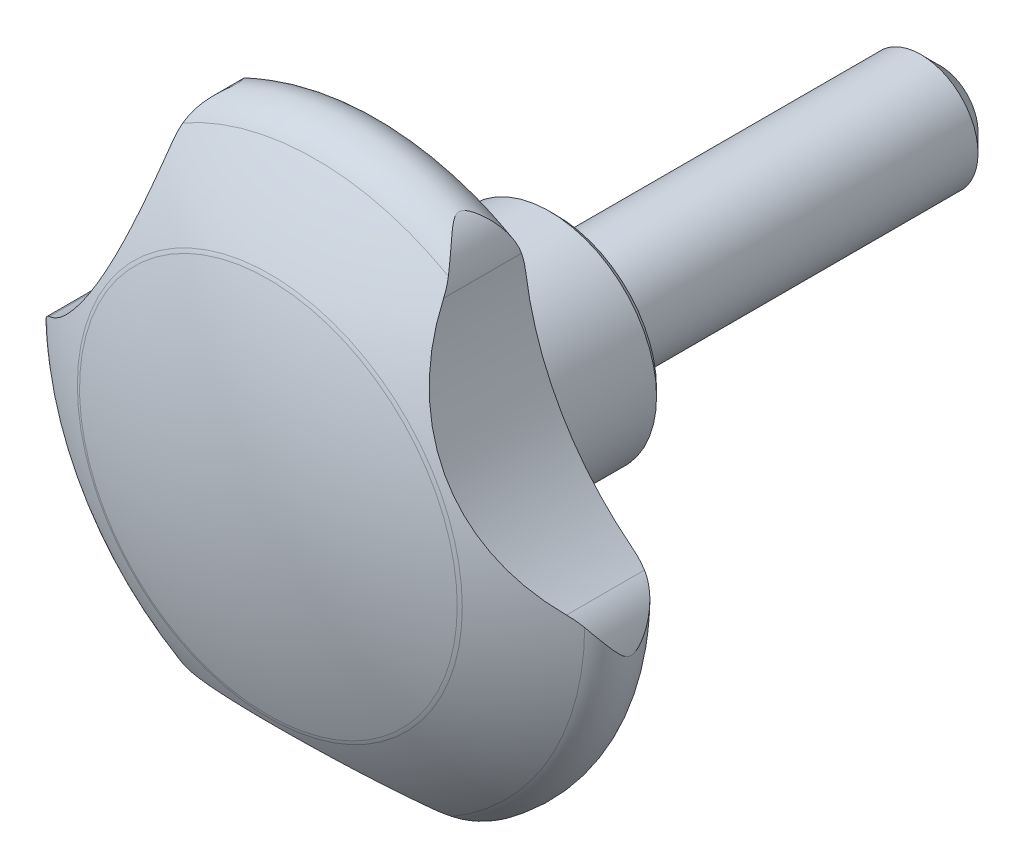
ISO-10303-21;
HEADER;
FILE_DESCRIPTION(('STEP AP214'),'2;1');
FILE_NAME('part.step','',(''),(''),'','','');
FILE_SCHEMA(('AUTOMOTIVE_DESIGN { 1 0 10303 214 1 1 1 1 }'));
ENDSEC;
DATA;
#1=APPLICATION_CONTEXT('core data for automotive mechanical design processes');
#2=APPLICATION_PROTOCOL_DEFINITION('international standard','automotive_design',2000,#1);
#3=PRODUCT_CONTEXT('',#1,'mechanical');
#4=PRODUCT('Part','Part','',(#3));
#5=PRODUCT_RELATED_PRODUCT_CATEGORY('part','',(#4));
#6=PRODUCT_DEFINITION_FORMATION('','',#4);
#7=PRODUCT_DEFINITION_CONTEXT('part definition',#1,'design');
#8=PRODUCT_DEFINITION('design','',#6,#7);
#9=PRODUCT_DEFINITION_SHAPE('','',#8);
#10=(LENGTH_UNIT() NAMED_UNIT(*) SI_UNIT(.MILLI.,.METRE.));
#11=(NAMED_UNIT(*) PLANE_ANGLE_UNIT() SI_UNIT($,.RADIAN.));
#12=(NAMED_UNIT(*) SI_UNIT($,.STERADIAN.) SOLID_ANGLE_UNIT());
#13=UNCERTAINTY_MEASURE_WITH_UNIT(LENGTH_MEASURE(1.E-05),#10,'distance_accuracy_value','');
#14=(GEOMETRIC_REPRESENTATION_CONTEXT(3) GLOBAL_UNCERTAINTY_ASSIGNED_CONTEXT((#13)) GLOBAL_UNIT_ASSIGNED_CONTEXT((#10,
#11,#12)) REPRESENTATION_CONTEXT('',''));
#15=CARTESIAN_POINT('',(0.,0.,0.));
#16=DIRECTION('',(0.,0.,1.));
#17=DIRECTION('',(1.,0.,0.));
#18=AXIS2_PLACEMENT_3D('',#15,#16,#17);
#19=CARTESIAN_POINT('',(0.,0.,22.25));
#20=DIRECTION('',(0.,0.,1.));
#21=DIRECTION('',(1.,0.,0.));
#22=AXIS2_PLACEMENT_3D('',#19,#20,#21);
#23=TOROIDAL_SURFACE('',#22,25.75,4.25);
#24=CARTESIAN_POINT('',(0.,0.,18.));
#25=DIRECTION('',(0.,0.,1.));
#26=DIRECTION('',(1.,0.,0.));
#27=AXIS2_PLACEMENT_3D('',#24,#25,#26);
#28=CIRCLE('',#27,25.75);
#29=CARTESIAN_POINT('',(11.2198622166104,-23.1770833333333,18.));
#30=VERTEX_POINT('',#29);
#31=CARTESIAN_POINT('',(25.6818740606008,1.87185596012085,18.));
#32=VERTEX_POINT('',#31);
#33=EDGE_CURVE('E379',#30,#32,#28,.T.);
#34=ORIENTED_EDGE('',*,*,#33,.T.);
#35=CARTESIAN_POINT('',(28.3586455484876,0.00320444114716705,25.6052149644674));
#36=CARTESIAN_POINT('',(28.2516925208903,0.0695044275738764,25.6883867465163));
#37=CARTESIAN_POINT('',(28.1418002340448,0.138584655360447,25.7654151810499));
#38=CARTESIAN_POINT('',(27.9176494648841,0.281624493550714,25.9072450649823));
#39=CARTESIAN_POINT('',(27.8033970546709,0.355577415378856,25.9720628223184));
#40=CARTESIAN_POINT('',(27.5728544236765,0.507132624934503,26.0891894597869));
#41=CARTESIAN_POINT('',(27.4565942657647,0.584693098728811,26.1416123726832));
#42=CARTESIAN_POINT('',(27.2220769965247,0.743594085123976,26.2351405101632));
#43=CARTESIAN_POINT('',(27.1038191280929,0.824936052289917,26.276241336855));
#44=CARTESIAN_POINT('',(26.8503622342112,1.00202466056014,26.3523826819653));
#45=CARTESIAN_POINT('',(26.7150218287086,1.09823829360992,26.3858669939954));
#46=CARTESIAN_POINT('',(26.4442444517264,1.29418495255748,26.439718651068));
#47=CARTESIAN_POINT('',(26.3088074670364,1.39391981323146,26.4600790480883));
#48=CARTESIAN_POINT('',(25.9029090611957,1.69818625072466,26.5029042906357));
#49=CARTESIAN_POINT('',(25.6336969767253,1.90719632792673,26.5068760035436));
#50=CARTESIAN_POINT('',(25.1665412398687,2.28277908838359,26.4769466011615));
#51=CARTESIAN_POINT('',(24.9666600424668,2.44783929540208,26.4516891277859));
#52=CARTESIAN_POINT('',(24.5733706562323,2.78118653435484,26.3796707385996));
#53=CARTESIAN_POINT('',(24.3799662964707,2.94947538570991,26.3328973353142));
#54=CARTESIAN_POINT('',(24.000823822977,3.28788639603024,26.2205572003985));
#55=CARTESIAN_POINT('',(23.8150784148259,3.45800660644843,26.1550088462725));
#56=CARTESIAN_POINT('',(23.4515313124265,3.79932659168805,26.0073250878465));
#57=CARTESIAN_POINT('',(23.2737257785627,3.97052579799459,25.9251978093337));
#58=CARTESIAN_POINT('',(23.0436302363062,4.19748748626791,25.8065678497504));
#59=CARTESIAN_POINT('',(22.9876855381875,4.25311091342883,25.7767195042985));
#60=CARTESIAN_POINT('',(22.8766589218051,4.36436741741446,25.7154968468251));
#61=CARTESIAN_POINT('',(22.8215769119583,4.42000049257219,25.6841226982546));
#62=CARTESIAN_POINT('',(22.6228730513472,4.62225830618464,25.567348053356));
#63=CARTESIAN_POINT('',(22.4818040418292,4.7688662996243,25.4775211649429));
#64=CARTESIAN_POINT('',(22.2057864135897,5.06149285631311,25.2880284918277));
#65=CARTESIAN_POINT('',(22.0708384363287,5.20751135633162,25.1883616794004));
#66=CARTESIAN_POINT('',(21.8074497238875,5.49810787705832,24.9793536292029));
#67=CARTESIAN_POINT('',(21.6790015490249,5.64268738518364,24.8700238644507));
#68=CARTESIAN_POINT('',(21.4289742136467,5.92948922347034,24.6410588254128));
#69=CARTESIAN_POINT('',(21.3073919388,6.07171260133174,24.5214282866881));
#70=CARTESIAN_POINT('',(21.0905557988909,6.33002794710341,24.2899398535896));
#71=CARTESIAN_POINT('',(20.9941694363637,6.44671035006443,24.1798209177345));
#72=CARTESIAN_POINT('',(20.8545182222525,6.61826513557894,24.0064049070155));
#73=CARTESIAN_POINT('',(20.8086697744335,6.67502344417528,23.9470516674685));
#74=CARTESIAN_POINT('',(20.7190244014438,6.78680408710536,23.8252533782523));
#75=CARTESIAN_POINT('',(20.6752270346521,6.84182679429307,23.7628090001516));
#76=CARTESIAN_POINT('',(20.5893723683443,6.95043375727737,23.6331660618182));
#77=CARTESIAN_POINT('',(20.5473580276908,7.00397691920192,23.5659041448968));
#78=CARTESIAN_POINT('',(20.4665524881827,7.10763492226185,23.4267569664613));
#79=CARTESIAN_POINT('',(20.4277647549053,7.15774606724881,23.3548668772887));
#80=CARTESIAN_POINT('',(20.3549250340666,7.25241006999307,23.2062302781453));
#81=CARTESIAN_POINT('',(20.3208340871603,7.29700829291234,23.1295325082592));
#82=CARTESIAN_POINT('',(20.2588472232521,7.37850158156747,22.9699023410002));
#83=CARTESIAN_POINT('',(20.2309337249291,7.41541849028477,22.8869885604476));
#84=CARTESIAN_POINT('',(20.1889604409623,7.47112318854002,22.732981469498));
#85=CARTESIAN_POINT('',(20.1732132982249,7.49210117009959,22.6631680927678));
#86=CARTESIAN_POINT('',(20.148771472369,7.52471351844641,22.5202234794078));
#87=CARTESIAN_POINT('',(20.1400631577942,7.53636594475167,22.4470989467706));
#88=CARTESIAN_POINT('',(20.1308624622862,7.54867822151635,22.2988172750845));
#89=CARTESIAN_POINT('',(20.1304302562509,7.54925756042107,22.223649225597));
#90=CARTESIAN_POINT('',(20.1380098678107,7.5391130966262,22.0744759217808));
#91=CARTESIAN_POINT('',(20.1460326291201,7.52837464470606,22.0004723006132));
#92=CARTESIAN_POINT('',(20.1718648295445,7.49389425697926,21.8402662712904));
#93=CARTESIAN_POINT('',(20.1914073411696,7.46785323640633,21.7548612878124));
#94=CARTESIAN_POINT('',(20.2383689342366,7.40558163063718,21.5901708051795));
#95=CARTESIAN_POINT('',(20.2658081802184,7.36932496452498,21.510901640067));
#96=CARTESIAN_POINT('',(20.3249722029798,7.29159781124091,21.3613179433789));
#97=CARTESIAN_POINT('',(20.3564784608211,7.2503978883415,21.2907707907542));
#98=CARTESIAN_POINT('',(20.4232268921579,7.16363713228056,21.1542288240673));
#99=CARTESIAN_POINT('',(20.4584728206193,7.11807192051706,21.0882386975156));
#100=CARTESIAN_POINT('',(20.5318957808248,7.02375954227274,20.9599363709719));
#101=CARTESIAN_POINT('',(20.5700817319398,6.9750027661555,20.8976364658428));
#102=CARTESIAN_POINT('',(20.648687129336,6.8753096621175,20.7763532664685));
#103=CARTESIAN_POINT('',(20.6891056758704,6.82437421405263,20.7173686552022));
#104=CARTESIAN_POINT('',(20.7961257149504,6.69044218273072,20.5683122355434));
#105=CARTESIAN_POINT('',(20.864141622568,6.60621299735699,20.4803667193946));
#106=CARTESIAN_POINT('',(21.0039095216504,6.43511662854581,20.3101585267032));
#107=CARTESIAN_POINT('',(21.0756632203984,6.34824824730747,20.2278984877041));
#108=CARTESIAN_POINT('',(21.2224640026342,6.1726147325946,20.0681363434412));
#109=CARTESIAN_POINT('',(21.2975158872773,6.08384693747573,19.9906415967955));
#110=CARTESIAN_POINT('',(21.4504952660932,5.90508128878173,19.8400211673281));
#111=CARTESIAN_POINT('',(21.5284231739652,5.81508325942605,19.7668961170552));
#112=CARTESIAN_POINT('',(21.7666463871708,5.54332187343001,19.5531868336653));
#113=CARTESIAN_POINT('',(21.9309826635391,5.36026957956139,19.4186954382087));
#114=CARTESIAN_POINT('',(22.2693804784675,4.99283736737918,19.165264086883));
#115=CARTESIAN_POINT('',(22.443433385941,4.80845875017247,19.0463106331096));
#116=CARTESIAN_POINT('',(22.8105978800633,4.42953051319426,18.818523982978));
#117=CARTESIAN_POINT('',(23.0042306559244,4.23495965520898,18.7105610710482));
#118=CARTESIAN_POINT('',(23.4019464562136,3.84641859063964,18.514115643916));
#119=CARTESIAN_POINT('',(23.6060336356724,3.65244865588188,18.4256409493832));
#120=CARTESIAN_POINT('',(24.0236567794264,3.26681798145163,18.2711050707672));
#121=CARTESIAN_POINT('',(24.2371671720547,3.0751525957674,18.2049869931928));
#122=CARTESIAN_POINT('',(24.6732364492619,2.69506258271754,18.0983250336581));
#123=CARTESIAN_POINT('',(24.8957901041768,2.50663616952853,18.0577665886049));
#124=CARTESIAN_POINT('',(25.2895814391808,2.18307564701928,18.0130142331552));
#125=CARTESIAN_POINT('',(25.4591317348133,2.04681269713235,18.0021108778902));
#126=CARTESIAN_POINT('',(25.8013436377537,1.777876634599,17.998443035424));
#127=CARTESIAN_POINT('',(25.9740054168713,1.64520372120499,18.0056795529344));
#128=CARTESIAN_POINT('',(26.3200923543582,1.38519302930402,18.0401865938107));
#129=CARTESIAN_POINT('',(26.4935096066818,1.25783226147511,18.0673586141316));
#130=CARTESIAN_POINT('',(26.8397580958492,1.00914654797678,18.1434775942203));
#131=CARTESIAN_POINT('',(27.0125896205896,0.887818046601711,18.1924115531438));
#132=CARTESIAN_POINT('',(27.3928409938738,0.626688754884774,18.3271694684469));
#133=CARTESIAN_POINT('',(27.5995408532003,0.488666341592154,18.4187275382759));
#134=CARTESIAN_POINT('',(27.9019772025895,0.291783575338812,18.5841459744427));
#135=CARTESIAN_POINT('',(28.0019140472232,0.227605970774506,18.6442705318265));
#136=CARTESIAN_POINT('',(28.198154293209,0.103148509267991,18.7740483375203));
#137=CARTESIAN_POINT('',(28.2944534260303,0.0428731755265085,18.8437123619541));
#138=CARTESIAN_POINT('',(28.3884330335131,-0.0152404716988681,18.9181612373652));
#139=B_SPLINE_CURVE_WITH_KNOTS('',3,(#35,#36,#37,#38,#39,#40,#41,#42,#43,#44,#45,#46,#47,#48,
#49,#50,#51,#52,#53,#54,#55,#56,#57,#58,#59,#60,#61,#62,#63,#64,#65,#66,#67,#68,#69,#70,#71,#72,
#73,#74,#75,#76,#77,#78,#79,#80,#81,#82,#83,#84,#85,#86,#87,#88,#89,#90,#91,#92,#93,#94,#95,#96,
#97,#98,#99,#100,#101,#102,#103,#104,#105,#106,#107,#108,#109,#110,#111,#112,#113,#114,#115,
#116,#117,#118,#119,#120,#121,#122,#123,#124,#125,#126,#127,#128,#129,#130,#131,#132,#133,#134,
#135,#136,#137,#138),.UNSPECIFIED.,.F.,.F.,(4,2,2,2,2,2,2,2,2,2,2,2,2,2,2,2,2,2,2,2,2,2,2,2,2,2,
2,2,2,2,2,2,2,2,2,2,2,2,2,2,2,2,2,2,2,2,2,2,2,2,2,4),(0.,0.452219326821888,0.903830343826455,
1.35110905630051,1.79856126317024,2.30613226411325,2.81397176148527,3.8327599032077,
4.61318343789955,5.39406048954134,6.17417579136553,6.95390966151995,7.20694459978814,
7.45995249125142,8.12681848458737,8.7937542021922,9.45990842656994,10.1257580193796,
10.6868350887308,10.9689321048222,11.2509681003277,11.5378614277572,11.8250590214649,
12.1097088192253,12.3935377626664,12.6164789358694,12.838987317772,13.0631129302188,
13.287528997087,13.5601870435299,13.8335476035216,14.0958392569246,14.3583968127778,
14.6217849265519,14.8850676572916,15.3032430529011,15.7216111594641,16.140609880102,
16.5596691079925,17.4000471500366,18.2396902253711,19.1238259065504,20.0083157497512,
20.8905374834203,21.7722560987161,22.4249345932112,23.0776492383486,23.7271603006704,
24.3762838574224,25.167654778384,25.5666234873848,25.9660466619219),.UNSPECIFIED.);
#140=CARTESIAN_POINT('',(27.1837405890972,0.770283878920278,18.2530660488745));
#141=VERTEX_POINT('',#140);
#142=EDGE_CURVE('E186',#32,#141,#139,.T.);
#143=ORIENTED_EDGE('',*,*,#142,.T.);
#144=CARTESIAN_POINT('',(28.2964873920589,-0.217782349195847,25.6520042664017));
#145=CARTESIAN_POINT('',(28.4017556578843,-0.337720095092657,25.5724558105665));
#146=CARTESIAN_POINT('',(28.5009544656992,-0.460394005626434,25.4891888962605));
#147=CARTESIAN_POINT('',(28.6874204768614,-0.710052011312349,25.3160467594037));
#148=CARTESIAN_POINT('',(28.7746893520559,-0.837035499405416,25.2261724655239));
#149=CARTESIAN_POINT('',(28.939213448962,-1.09683967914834,25.0387057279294));
#150=CARTESIAN_POINT('',(29.0162246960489,-1.22972675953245,24.9409922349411));
#151=CARTESIAN_POINT('',(29.1583237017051,-1.49756950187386,24.7400682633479));
#152=CARTESIAN_POINT('',(29.2234169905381,-1.63252417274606,24.6368603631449));
#153=CARTESIAN_POINT('',(29.3475642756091,-1.91588975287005,24.4151899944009));
#154=CARTESIAN_POINT('',(29.4054906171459,-2.06438293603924,24.296202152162));
#155=CARTESIAN_POINT('',(29.5080814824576,-2.36068481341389,24.0509799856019));
#156=CARTESIAN_POINT('',(29.552712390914,-2.50849085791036,23.9247282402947));
#157=CARTESIAN_POINT('',(29.6096621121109,-2.72566652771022,23.7294892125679));
#158=CARTESIAN_POINT('',(29.6268949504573,-2.79683278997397,23.6638991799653));
#159=CARTESIAN_POINT('',(29.6582713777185,-2.9372412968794,23.529989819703));
#160=CARTESIAN_POINT('',(29.6724158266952,-3.00648407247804,23.4616712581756));
#161=CARTESIAN_POINT('',(29.6976441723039,-3.14157233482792,23.3217828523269));
#162=CARTESIAN_POINT('',(29.708741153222,-3.20743132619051,23.2502284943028));
#163=CARTESIAN_POINT('',(29.7280392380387,-3.33395767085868,23.1023561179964));
#164=CARTESIAN_POINT('',(29.7362449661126,-3.39463319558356,23.026045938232));
#165=CARTESIAN_POINT('',(29.7475571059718,-3.48754208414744,22.8939042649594));
#166=CARTESIAN_POINT('',(29.7514474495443,-3.52239924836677,22.8400105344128));
#167=CARTESIAN_POINT('',(29.7580672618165,-3.58597889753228,22.7286257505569));
#168=CARTESIAN_POINT('',(29.7607983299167,-3.61470980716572,22.6711397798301));
#169=CARTESIAN_POINT('',(29.7647774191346,-3.6589890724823,22.561969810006));
#170=CARTESIAN_POINT('',(29.7661948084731,-3.67592407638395,22.5108716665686));
#171=CARTESIAN_POINT('',(29.768244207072,-3.70106711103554,22.4065499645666));
#172=CARTESIAN_POINT('',(29.7688776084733,-3.70929060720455,22.353330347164));
#173=CARTESIAN_POINT('',(29.7693634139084,-3.71555476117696,22.2459140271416));
#174=CARTESIAN_POINT('',(29.7692108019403,-3.71353002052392,22.1917132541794));
#175=CARTESIAN_POINT('',(29.768113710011,-3.69955495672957,22.0846268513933));
#176=CARTESIAN_POINT('',(29.7671682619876,-3.68759249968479,22.0317429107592));
#177=CARTESIAN_POINT('',(29.7639777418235,-3.64977293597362,21.9091740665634));
#178=CARTESIAN_POINT('',(29.7613782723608,-3.6203876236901,21.8406252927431));
#179=CARTESIAN_POINT('',(29.7546364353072,-3.55207647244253,21.7084865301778));
#180=CARTESIAN_POINT('',(29.7504875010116,-3.51311027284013,21.6449190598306));
#181=CARTESIAN_POINT('',(29.7379432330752,-3.40704448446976,21.4890217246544));
#182=CARTESIAN_POINT('',(29.7284635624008,-3.33604366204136,21.3994899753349));
#183=CARTESIAN_POINT('',(29.7055318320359,-3.18718496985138,21.226771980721));
#184=CARTESIAN_POINT('',(29.6920700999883,-3.10931073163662,21.1436018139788));
#185=CARTESIAN_POINT('',(29.6609396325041,-2.94934051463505,20.9813292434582));
#186=CARTESIAN_POINT('',(29.6432474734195,-2.8672230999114,20.9022525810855));
#187=CARTESIAN_POINT('',(29.60359742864,-2.70091874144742,20.7476284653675));
#188=CARTESIAN_POINT('',(29.5816437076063,-2.61673388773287,20.6720776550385));
#189=CARTESIAN_POINT('',(29.5118027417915,-2.37157397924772,20.457533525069));
#190=CARTESIAN_POINT('',(29.458251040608,-2.20908748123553,20.3220650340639));
#191=CARTESIAN_POINT('',(29.33479433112,-1.88378678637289,20.0589810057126));
#192=CARTESIAN_POINT('',(29.2648766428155,-1.72097243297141,19.9313716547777));
#193=CARTESIAN_POINT('',(29.1086142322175,-1.39849418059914,19.6846578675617));
#194=CARTESIAN_POINT('',(29.0223689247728,-1.23881735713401,19.5655076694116));
#195=CARTESIAN_POINT('',(28.8326945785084,-0.923725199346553,19.3355623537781));
#196=CARTESIAN_POINT('',(28.7292703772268,-0.768308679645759,19.2247648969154));
#197=CARTESIAN_POINT('',(28.5231862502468,-0.488675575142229,19.030153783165));
#198=CARTESIAN_POINT('',(28.4231728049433,-0.363516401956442,18.9448920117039));
#199=CARTESIAN_POINT('',(28.2107060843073,-0.118897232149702,18.7822070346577));
#200=CARTESIAN_POINT('',(28.0982601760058,0.000566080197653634,18.7047792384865));
#201=CARTESIAN_POINT('',(27.8596275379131,0.233650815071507,18.5583105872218));
#202=CARTESIAN_POINT('',(27.7333138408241,0.347201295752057,18.4893620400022));
#203=CARTESIAN_POINT('',(27.4679083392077,0.565733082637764,18.3624343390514));
#204=CARTESIAN_POINT('',(27.3287910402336,0.670696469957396,18.304477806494));
#205=CARTESIAN_POINT('',(27.1835405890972,0.770421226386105,18.2529952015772));
#206=B_SPLINE_CURVE_WITH_KNOTS('',3,(#144,#145,#146,#147,#148,#149,#150,#151,#152,#153,#154,
#155,#156,#157,#158,#159,#160,#161,#162,#163,#164,#165,#166,#167,#168,#169,#170,#171,#172,#173,
#174,#175,#176,#177,#178,#179,#180,#181,#182,#183,#184,#185,#186,#187,#188,#189,#190,#191,#192,
#193,#194,#195,#196,#197,#198,#199,#200,#201,#202,#203,#204,#205),.UNSPECIFIED.,.F.,.F.,(4,2,2,
2,2,2,2,2,2,2,2,2,2,2,2,2,2,2,2,2,2,2,2,2,2,2,2,2,2,2,4),(0.,0.534644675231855,1.06921434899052,
1.61482207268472,2.16017597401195,2.7563381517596,3.35399507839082,3.6488305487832,
3.94358380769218,4.23705102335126,4.53004672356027,4.72269091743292,4.91506845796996,
5.07602562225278,5.23669656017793,5.39839409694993,5.5602893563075,5.78289311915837,
6.00645119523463,6.34956383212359,6.69351682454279,7.03942026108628,7.38498734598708,
8.0388123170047,8.69314554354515,9.34361587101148,9.99390333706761,10.5377375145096,
11.0812511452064,11.6302379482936,12.1803425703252),.UNSPECIFIED.);
#207=CARTESIAN_POINT('',(28.2967521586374,-0.218084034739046,25.6518042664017));
#208=VERTEX_POINT('',#207);
#209=EDGE_CURVE('E180',#208,#141,#206,.T.);
#210=ORIENTED_EDGE('',*,*,#209,.F.);
#211=CARTESIAN_POINT('',(0.,0.,25.6518042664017));
#212=DIRECTION('',(0.,0.,1.));
#213=DIRECTION('',(1.,0.,0.));
#214=AXIS2_PLACEMENT_3D('',#211,#212,#213);
#215=CIRCLE('',#214,28.2975925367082);
#216=CARTESIAN_POINT('',(14.3372423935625,-24.3966641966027,25.6518042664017));
#217=VERTEX_POINT('',#216);
#218=EDGE_CURVE('E382',#217,#208,#215,.T.);
#219=ORIENTED_EDGE('',*,*,#218,.F.);
#220=CARTESIAN_POINT('',(12.924584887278,-23.9268563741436,18.2530013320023));
#221=CARTESIAN_POINT('',(13.08276589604,-24.0023976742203,18.3042220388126));
#222=CARTESIAN_POINT('',(13.2424032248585,-24.0700892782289,18.3618521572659));
#223=CARTESIAN_POINT('',(13.5627184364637,-24.1902150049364,18.4880268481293));
#224=CARTESIAN_POINT('',(13.7233936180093,-24.24267920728,18.5565494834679));
#225=CARTESIAN_POINT('',(14.0437217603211,-24.3328537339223,18.7024437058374));
#226=CARTESIAN_POINT('',(14.2033757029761,-24.3706391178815,18.7797675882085));
#227=CARTESIAN_POINT('',(14.5214120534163,-24.4326008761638,18.9422532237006));
#228=CARTESIAN_POINT('',(14.6797936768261,-24.4567694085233,19.0274194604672));
#229=CARTESIAN_POINT('',(15.0162830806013,-24.4947372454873,19.2169298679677));
#230=CARTESIAN_POINT('',(15.1940368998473,-24.5066032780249,19.3222875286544));
#231=CARTESIAN_POINT('',(15.5451457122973,-24.5148070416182,19.5406380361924));
#232=CARTESIAN_POINT('',(15.7185000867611,-24.5111426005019,19.6536319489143));
#233=CARTESIAN_POINT('',(16.0594156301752,-24.4895504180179,19.8865931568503));
#234=CARTESIAN_POINT('',(16.2269789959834,-24.4716281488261,20.006557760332));
#235=CARTESIAN_POINT('',(16.5548027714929,-24.4229470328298,20.2534912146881));
#236=CARTESIAN_POINT('',(16.7150668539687,-24.3921947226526,20.3804564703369));
#237=CARTESIAN_POINT('',(16.9762277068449,-24.3313800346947,20.6006819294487));
#238=CARTESIAN_POINT('',(17.0796984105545,-24.3042514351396,20.6917126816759));
#239=CARTESIAN_POINT('',(17.2810998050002,-24.2458665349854,20.8787922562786));
#240=CARTESIAN_POINT('',(17.3790215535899,-24.2146038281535,20.9748487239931));
#241=CARTESIAN_POINT('',(17.567664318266,-24.1492641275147,21.1746262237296));
#242=CARTESIAN_POINT('',(17.6583241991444,-24.1151673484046,21.2784004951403));
#243=CARTESIAN_POINT('',(17.7837928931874,-24.0648870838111,21.4422579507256));
#244=CARTESIAN_POINT('',(17.8238236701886,-24.0482890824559,21.4981765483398));
#245=CARTESIAN_POINT('',(17.8988700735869,-24.0163145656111,21.6135699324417));
#246=CARTESIAN_POINT('',(17.9338937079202,-24.0009361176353,21.6730388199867));
#247=CARTESIAN_POINT('',(17.9928195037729,-23.9745069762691,21.7890600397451));
#248=CARTESIAN_POINT('',(18.0175507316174,-23.9631586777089,21.8451108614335));
#249=CARTESIAN_POINT('',(18.058633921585,-23.9440703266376,21.9607213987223));
#250=CARTESIAN_POINT('',(18.0750184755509,-23.9363162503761,22.020266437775));
#251=CARTESIAN_POINT('',(18.0944718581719,-23.9270690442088,22.1296611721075));
#252=CARTESIAN_POINT('',(18.0995520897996,-23.9246321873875,22.1790605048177));
#253=CARTESIAN_POINT('',(18.1018003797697,-23.9235561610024,22.2781056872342));
#254=CARTESIAN_POINT('',(18.0989668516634,-23.9249177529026,22.3277515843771));
#255=CARTESIAN_POINT('',(18.0858826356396,-23.9311561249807,22.4255131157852));
#256=CARTESIAN_POINT('',(18.0756699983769,-23.9360148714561,22.4736352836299));
#257=CARTESIAN_POINT('',(18.049196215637,-23.9484610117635,22.5677863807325));
#258=CARTESIAN_POINT('',(18.0329297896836,-23.9560507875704,22.6138134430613));
#259=CARTESIAN_POINT('',(17.9769122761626,-23.9817775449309,22.7494010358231));
#260=CARTESIAN_POINT('',(17.9301377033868,-24.0027725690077,22.8354413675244));
#261=CARTESIAN_POINT('',(17.826140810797,-24.047462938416,23.000376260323));
#262=CARTESIAN_POINT('',(17.7688572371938,-24.0711737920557,23.0792246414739));
#263=CARTESIAN_POINT('',(17.6567692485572,-24.1153202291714,23.2204718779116));
#264=CARTESIAN_POINT('',(17.6028411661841,-24.1357241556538,23.2835836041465));
#265=CARTESIAN_POINT('',(17.49155082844,-24.1759050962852,23.4069300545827));
#266=CARTESIAN_POINT('',(17.4341870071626,-24.1956818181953,23.4671634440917));
#267=CARTESIAN_POINT('',(17.2579837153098,-24.2533254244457,23.6447132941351));
#268=CARTESIAN_POINT('',(17.135194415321,-24.2894404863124,23.7586866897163));
#269=CARTESIAN_POINT('',(16.8822081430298,-24.3547311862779,23.9805991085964));
#270=CARTESIAN_POINT('',(16.7519984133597,-24.3838943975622,24.0885270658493));
#271=CARTESIAN_POINT('',(16.4860377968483,-24.4339247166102,24.2991388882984));
#272=CARTESIAN_POINT('',(16.3502914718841,-24.4547985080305,24.4018269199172));
#273=CARTESIAN_POINT('',(16.0636195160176,-24.4885976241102,24.6101157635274));
#274=CARTESIAN_POINT('',(15.912328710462,-24.5007895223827,24.7153347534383));
#275=CARTESIAN_POINT('',(15.6054467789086,-24.5135448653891,24.920098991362));
#276=CARTESIAN_POINT('',(15.4498552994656,-24.5141073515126,25.0196437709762));
#277=CARTESIAN_POINT('',(15.1360344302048,-24.5027410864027,25.2121034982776));
#278=CARTESIAN_POINT('',(14.9778207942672,-24.49087078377,25.3050472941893));
#279=CARTESIAN_POINT('',(14.6589247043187,-24.4538822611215,25.4839809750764));
#280=CARTESIAN_POINT('',(14.4982409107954,-24.4287565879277,25.5699669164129));
#281=CARTESIAN_POINT('',(14.3368487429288,-24.3965857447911,25.6520042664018));
#282=B_SPLINE_CURVE_WITH_KNOTS('',3,(#220,#221,#222,#223,#224,#225,#226,#227,#228,#229,#230,
#231,#232,#233,#234,#235,#236,#237,#238,#239,#240,#241,#242,#243,#244,#245,#246,#247,#248,#249,
#250,#251,#252,#253,#254,#255,#256,#257,#258,#259,#260,#261,#262,#263,#264,#265,#266,#267,#268,
#269,#270,#271,#272,#273,#274,#275,#276,#277,#278,#279,#280,#281),.UNSPECIFIED.,.F.,.F.,(4,2,2,
2,2,2,2,2,2,2,2,2,2,2,2,2,2,2,2,2,2,2,2,2,2,2,2,2,2,2,4),(0.,0.547312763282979,1.09353691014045,
1.63692998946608,2.18063569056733,2.80070994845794,3.42087093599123,4.04079401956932,
4.66040165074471,5.08155483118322,5.50336845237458,5.92842440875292,6.14048239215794,
6.35219734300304,6.53859721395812,6.72426354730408,6.87269653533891,7.02115928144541,
7.1688618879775,7.3166936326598,7.6154245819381,7.91595550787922,8.17224716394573,
8.42865653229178,8.94225275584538,9.45676028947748,9.9708521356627,10.5244200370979,
11.0780335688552,11.6290561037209,12.1803887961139),.UNSPECIFIED.);
#283=CARTESIAN_POINT('',(12.924784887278,-23.9269518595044,18.2530660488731));
#284=VERTEX_POINT('',#283);
#285=EDGE_CURVE('E174',#284,#217,#282,.T.);
#286=ORIENTED_EDGE('',*,*,#285,.F.);
#287=CARTESIAN_POINT('',(12.924984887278,-23.9270473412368,18.2531307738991));
#288=CARTESIAN_POINT('',(12.7672690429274,-23.8517302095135,18.2020778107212));
#289=CARTESIAN_POINT('',(12.6068056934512,-23.7768358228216,18.1593603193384));
#290=CARTESIAN_POINT('',(12.2820392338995,-23.6287926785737,18.089570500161));
#291=CARTESIAN_POINT('',(12.11774296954,-23.5556412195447,18.0624722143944));
#292=CARTESIAN_POINT('',(11.7886938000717,-23.4127107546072,18.0230035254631));
#293=CARTESIAN_POINT('',(11.6239777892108,-23.3428993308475,18.0104369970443));
#294=CARTESIAN_POINT('',(11.2928530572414,-23.2060514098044,17.9982572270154));
#295=CARTESIAN_POINT('',(11.1264434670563,-23.139016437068,17.9986510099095));
#296=CARTESIAN_POINT('',(10.7217665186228,-22.9802040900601,18.0140274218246));
#297=CARTESIAN_POINT('',(10.4830864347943,-22.8900513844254,18.0351533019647));
#298=CARTESIAN_POINT('',(10.0060375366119,-22.7167238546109,18.0986373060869));
#299=CARTESIAN_POINT('',(9.76766885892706,-22.6335514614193,18.1410027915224));
#300=CARTESIAN_POINT('',(9.29034910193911,-22.4736374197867,18.2448702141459));
#301=CARTESIAN_POINT('',(9.051414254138,-22.3969648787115,18.3065512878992));
#302=CARTESIAN_POINT('',(8.57636352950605,-22.2509518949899,18.4466585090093));
#303=CARTESIAN_POINT('',(8.34024702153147,-22.1816097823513,18.5250808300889));
#304=CARTESIAN_POINT('',(7.79541088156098,-22.0287134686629,18.7247959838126));
#305=CARTESIAN_POINT('',(7.48799032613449,-21.9478475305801,18.8517428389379));
#306=CARTESIAN_POINT('',(7.03266325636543,-21.835532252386,19.0599263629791));
#307=CARTESIAN_POINT('',(6.88173936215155,-21.7995665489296,19.1323448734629));
#308=CARTESIAN_POINT('',(6.58213009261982,-21.7305760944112,19.2829896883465));
#309=CARTESIAN_POINT('',(6.43344456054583,-21.6975511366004,19.3612155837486));
#310=CARTESIAN_POINT('',(6.13966927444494,-21.6345972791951,19.5229439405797));
#311=CARTESIAN_POINT('',(5.99456194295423,-21.604648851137,19.606406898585));
#312=CARTESIAN_POINT('',(5.70740797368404,-21.5475483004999,19.7793348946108));
#313=CARTESIAN_POINT('',(5.56536109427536,-21.5203959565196,19.8687994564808));
#314=CARTESIAN_POINT('',(5.28537592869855,-21.4689142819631,20.0541421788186));
#315=CARTESIAN_POINT('',(5.14743033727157,-21.4445796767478,20.1500078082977));
#316=CARTESIAN_POINT('',(4.87670431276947,-21.3987070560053,20.3493425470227));
#317=CARTESIAN_POINT('',(4.74392084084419,-21.3771673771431,20.4528070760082));
#318=CARTESIAN_POINT('',(4.55989706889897,-21.3485167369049,20.6072416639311));
#319=CARTESIAN_POINT('',(4.50555119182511,-21.3402134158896,20.6543000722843));
#320=CARTESIAN_POINT('',(4.39854911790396,-21.3241564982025,20.7504063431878));
#321=CARTESIAN_POINT('',(4.34589303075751,-21.3164029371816,20.7994543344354));
#322=CARTESIAN_POINT('',(4.24263984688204,-21.3014692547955,20.8998505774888));
#323=CARTESIAN_POINT('',(4.19204441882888,-21.2942895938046,20.9512006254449));
#324=CARTESIAN_POINT('',(4.09355777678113,-21.2805575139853,21.05650037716));
#325=CARTESIAN_POINT('',(4.04566610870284,-21.2740049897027,21.1104496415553));
#326=CARTESIAN_POINT('',(3.92703897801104,-21.2580485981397,21.2529656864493));
#327=CARTESIAN_POINT('',(3.85883192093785,-21.2491468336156,21.3437453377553));
#328=CARTESIAN_POINT('',(3.7360504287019,-21.2334795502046,21.5343265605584));
#329=CARTESIAN_POINT('',(3.68143468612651,-21.2267075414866,21.6340995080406));
#330=CARTESIAN_POINT('',(3.60973904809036,-21.2179483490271,21.805298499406));
#331=CARTESIAN_POINT('',(3.58622720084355,-21.2151164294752,21.8739345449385));
#332=CARTESIAN_POINT('',(3.55062020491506,-21.2108505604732,22.0141353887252));
#333=CARTESIAN_POINT('',(3.53850525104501,-21.209414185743,22.0856948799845));
#334=CARTESIAN_POINT('',(3.52735901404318,-21.2080920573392,22.2303167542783));
#335=CARTESIAN_POINT('',(3.5284065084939,-21.20821564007,22.3033855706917));
#336=CARTESIAN_POINT('',(3.54360528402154,-21.2100199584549,22.4481129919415));
#337=CARTESIAN_POINT('',(3.55776617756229,-21.2117018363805,22.5197705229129));
#338=CARTESIAN_POINT('',(3.60261000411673,-21.2170883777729,22.6789952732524));
#339=CARTESIAN_POINT('',(3.63675456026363,-21.2212207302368,22.7655480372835));
#340=CARTESIAN_POINT('',(3.71789399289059,-21.2312424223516,22.932323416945));
#341=CARTESIAN_POINT('',(3.7649299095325,-21.2371373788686,23.0125247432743));
#342=CARTESIAN_POINT('',(3.87724833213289,-21.2515426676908,23.1814030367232));
#343=CARTESIAN_POINT('',(3.94429830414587,-21.2603360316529,23.2688552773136));
#344=CARTESIAN_POINT('',(4.08628891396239,-21.2795120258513,23.4369990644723));
#345=CARTESIAN_POINT('',(4.16124357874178,-21.2898974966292,23.5176781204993));
#346=CARTESIAN_POINT('',(4.31724422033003,-21.3121627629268,23.6743129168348));
#347=CARTESIAN_POINT('',(4.39834501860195,-21.3240568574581,23.7502114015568));
#348=CARTESIAN_POINT('',(4.56433061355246,-21.3491326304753,23.8973493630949));
#349=CARTESIAN_POINT('',(4.64921255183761,-21.3623133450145,23.9685922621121));
#350=CARTESIAN_POINT('',(4.84405974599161,-21.3934609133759,24.1250579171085));
#351=CARTESIAN_POINT('',(4.9548615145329,-21.4117868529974,24.209163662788));
#352=CARTESIAN_POINT('',(5.17985331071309,-21.4503440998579,24.3722816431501));
#353=CARTESIAN_POINT('',(5.29404428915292,-21.4705759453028,24.4512924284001));
#354=CARTESIAN_POINT('',(5.52525580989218,-21.5129624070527,24.6049172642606));
#355=CARTESIAN_POINT('',(5.6422805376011,-21.5351200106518,24.6795241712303));
#356=CARTESIAN_POINT('',(5.87851786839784,-21.5813406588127,24.8245691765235));
#357=CARTESIAN_POINT('',(5.99773055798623,-21.6054037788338,24.8950071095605));
#358=CARTESIAN_POINT('',(6.23104037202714,-21.6540036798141,25.027926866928));
#359=CARTESIAN_POINT('',(6.34503246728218,-21.6784317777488,25.0906331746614));
#360=CARTESIAN_POINT('',(6.57447905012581,-21.7290241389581,25.2125770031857));
#361=CARTESIAN_POINT('',(6.68993355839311,-21.7551884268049,25.27181447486));
#362=CARTESIAN_POINT('',(6.92172288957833,-21.8091819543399,25.3865990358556));
#363=CARTESIAN_POINT('',(7.03805285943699,-21.8370046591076,25.4421589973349));
#364=CARTESIAN_POINT('',(7.27189439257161,-21.8944325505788,25.5497483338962));
#365=CARTESIAN_POINT('',(7.38940591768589,-21.9240376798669,25.6017778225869));
#366=CARTESIAN_POINT('',(7.50745214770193,-21.9545500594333,25.6520042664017));
#367=B_SPLINE_CURVE_WITH_KNOTS('',3,(#287,#288,#289,#290,#291,#292,#293,#294,#295,#296,#297,
#298,#299,#300,#301,#302,#303,#304,#305,#306,#307,#308,#309,#310,#311,#312,#313,#314,#315,#316,
#317,#318,#319,#320,#321,#322,#323,#324,#325,#326,#327,#328,#329,#330,#331,#332,#333,#334,#335,
#336,#337,#338,#339,#340,#341,#342,#343,#344,#345,#346,#347,#348,#349,#350,#351,#352,#353,#354,
#355,#356,#357,#358,#359,#360,#361,#362,#363,#364,#365,#366),.UNSPECIFIED.,.F.,.F.,(4,2,2,2,2,2,
2,2,2,2,2,2,2,2,2,2,2,2,2,2,2,2,2,2,2,2,2,2,2,2,2,2,2,2,2,2,2,2,2,4),(0.,0.54583960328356,
1.09076942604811,1.62825555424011,2.166033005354,2.93289855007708,3.7000300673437,
4.47449804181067,5.24878919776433,6.27429618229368,6.7878517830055,7.30137124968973,
7.81139832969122,8.32138499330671,8.83040100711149,9.33911268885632,9.55617423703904,
9.77324984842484,9.99049788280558,10.2077093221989,10.5486584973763,10.8885584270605,
11.105593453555,11.3222506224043,11.5402051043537,11.7583194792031,12.0361406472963,
12.3148567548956,12.6457589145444,12.9772584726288,13.312174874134,13.6468422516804,
14.0675828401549,14.488442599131,14.9099672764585,15.3315086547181,15.7285667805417,
16.1256305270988,16.5212216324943,16.9168000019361),.UNSPECIFIED.);
#368=EDGE_CURVE('E132',#284,#30,#367,.T.);
#369=ORIENTED_EDGE('',*,*,#368,.T.);
#370=EDGE_LOOP('',(#34,#143,#210,#219,#286,#369));
#371=FACE_BOUND('',#370,.T.);
#372=ADVANCED_FACE('F14',(#371),#23,.T.);
#373=CARTESIAN_POINT('',(-27.1835405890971,0.770421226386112,18.2529952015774));
#374=CARTESIAN_POINT('',(-27.3280522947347,0.671203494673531,18.3042154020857));
#375=CARTESIAN_POINT('',(-27.4664941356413,0.566799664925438,18.3618450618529));
#376=CARTESIAN_POINT('',(-27.7306847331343,0.349462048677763,18.4880189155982));
#377=CARTESIAN_POINT('',(-27.8564581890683,0.236545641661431,18.556541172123));
#378=CARTESIAN_POINT('',(-28.0947167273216,0.00422111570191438,18.7024346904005));
#379=CARTESIAN_POINT('',(-28.207267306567,-0.115150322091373,18.7797582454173));
#380=CARTESIAN_POINT('',(-28.4199469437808,-0.359596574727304,18.9422432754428));
#381=CARTESIAN_POINT('',(-28.5200688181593,-0.484674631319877,19.027409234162));
#382=CARTESIAN_POINT('',(-28.7211954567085,-0.757098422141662,19.2169188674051));
#383=CARTESIAN_POINT('',(-28.8203490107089,-0.905104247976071,19.3222760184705));
#384=CARTESIAN_POINT('',(-29.0030088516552,-1.20507060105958,19.5406255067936));
#385=CARTESIAN_POINT('',(-29.0865129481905,-1.35703167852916,19.6536189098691));
#386=CARTESIAN_POINT('',(-29.2382722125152,-1.66306850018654,19.8865790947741));
#387=CARTESIAN_POINT('',(-29.3065332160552,-1.81714341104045,20.0065431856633));
#388=CARTESIAN_POINT('',(-29.4282869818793,-2.12538706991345,20.2534755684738));
#389=CARTESIAN_POINT('',(-29.4817872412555,-2.27955573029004,20.380440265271));
#390=CARTESIAN_POINT('',(-29.5597017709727,-2.53613570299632,20.6006655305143));
#391=CARTESIAN_POINT('',(-29.5879436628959,-2.63930915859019,20.6916967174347));
#392=CARTESIAN_POINT('',(-29.638082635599,-2.84292218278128,20.8787771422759));
#393=CARTESIAN_POINT('',(-29.6599696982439,-2.94335721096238,20.9748340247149));
#394=CARTESIAN_POINT('',(-29.6977061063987,-3.13939847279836,21.1746122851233));
#395=CARTESIAN_POINT('',(-29.7135077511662,-3.23496165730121,21.278386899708));
#396=CARTESIAN_POINT('',(-29.7326986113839,-3.36876261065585,21.4422448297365));
#397=CARTESIAN_POINT('',(-29.7383398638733,-3.41172989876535,21.4981635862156));
#398=CARTESIAN_POINT('',(-29.7481726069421,-3.4927105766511,21.6135572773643));
#399=CARTESIAN_POINT('',(-29.7523664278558,-3.53073186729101,21.6730263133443));
#400=CARTESIAN_POINT('',(-29.7589412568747,-3.5949792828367,21.7890481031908));
#401=CARTESIAN_POINT('',(-29.7614790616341,-3.6220721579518,21.8450993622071));
#402=CARTESIAN_POINT('',(-29.7654898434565,-3.66719712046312,21.9607108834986));
#403=CARTESIAN_POINT('',(-29.7669669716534,-3.68526444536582,22.0202564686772));
#404=CARTESIAN_POINT('',(-29.7686854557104,-3.70673644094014,22.1296517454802));
#405=CARTESIAN_POINT('',(-29.7691152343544,-3.71235502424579,22.1790510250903));
#406=CARTESIAN_POINT('',(-29.7693075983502,-3.71484121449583,22.2780961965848));
#407=CARTESIAN_POINT('',(-29.7690700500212,-3.71170706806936,22.3277421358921));
#408=CARTESIAN_POINT('',(-29.7679306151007,-3.6972576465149,22.4255038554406));
#409=CARTESIAN_POINT('',(-29.7670321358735,-3.68598433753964,22.4736261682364));
#410=CARTESIAN_POINT('',(-29.7645740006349,-3.65683511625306,22.5677775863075));
#411=CARTESIAN_POINT('',(-29.7630137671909,-3.63895343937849,22.6138048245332));
#412=CARTESIAN_POINT('',(-29.7572852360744,-3.57757918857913,22.7493911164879));
#413=CARTESIAN_POINT('',(-29.7520803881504,-3.5265753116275,22.8354301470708));
#414=CARTESIAN_POINT('',(-29.7387854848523,-3.41416944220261,23.0003625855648));
#415=CARTESIAN_POINT('',(-29.7306782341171,-3.3527066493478,23.0792098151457));
#416=CARTESIAN_POINT('',(-29.7128669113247,-3.23356545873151,23.2204549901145));
#417=CARTESIAN_POINT('',(-29.7035735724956,-3.17666181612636,23.2835657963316));
#418=CARTESIAN_POINT('',(-29.6827269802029,-3.06019388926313,23.4069104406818));
#419=CARTESIAN_POINT('',(-29.6711726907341,-3.00062839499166,23.4671429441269));
#420=CARTESIAN_POINT('',(-29.6329934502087,-2.81921421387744,23.6446901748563));
#421=CARTESIAN_POINT('',(-29.6028766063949,-2.69482075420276,23.7586618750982));
#422=CARTESIAN_POINT('',(-29.5329297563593,-2.44308816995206,23.9805710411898));
#423=CARTESIAN_POINT('',(-29.4930826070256,-2.31574420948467,24.0884974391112));
#424=CARTESIAN_POINT('',(-29.4034335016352,-2.06040542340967,24.299106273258));
#425=CARTESIAN_POINT('',(-29.3536396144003,-1.93241120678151,24.4017928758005));
#426=CARTESIAN_POINT('',(-29.2395764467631,-1.66724493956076,24.6100839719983));
#427=CARTESIAN_POINT('',(-29.1744888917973,-1.53012337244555,24.7153063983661));
#428=CARTESIAN_POINT('',(-29.032092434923,-1.25797028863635,24.9200772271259));
#429=CARTESIAN_POINT('',(-28.954782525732,-1.12293894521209,25.0196251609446));
#430=CARTESIAN_POINT('',(-28.788025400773,-0.856837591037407,25.2120908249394));
#431=CARTESIAN_POINT('',(-28.6986366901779,-0.725751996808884,25.305037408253));
#432=CARTESIAN_POINT('',(-28.5071511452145,-0.468066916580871,25.483976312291));
#433=CARTESIAN_POINT('',(-28.4050471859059,-0.341469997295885,25.5699646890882));
#434=CARTESIAN_POINT('',(-28.2964873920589,-0.217782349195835,25.6520042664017));
#435=B_SPLINE_CURVE_WITH_KNOTS('',3,(#373,#374,#375,#376,#377,#378,#379,#380,#381,#382,#383,
#384,#385,#386,#387,#388,#389,#390,#391,#392,#393,#394,#395,#396,#397,#398,#399,#400,#401,#402,
#403,#404,#405,#406,#407,#408,#409,#410,#411,#412,#413,#414,#415,#416,#417,#418,#419,#420,#421,
#422,#423,#424,#425,#426,#427,#428,#429,#430,#431,#432,#433,#434),.UNSPECIFIED.,.F.,.F.,(4,2,2,
2,2,2,2,2,2,2,2,2,2,2,2,2,2,2,2,2,2,2,2,2,2,2,2,2,2,2,4),(0.,0.547312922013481,1.09353721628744,
1.6369303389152,2.18063608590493,2.8007090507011,3.42086874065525,4.04079059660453,
4.66039700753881,5.08155336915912,5.50337010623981,5.92842905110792,6.14048857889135,
6.35220508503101,6.53860727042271,6.72427590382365,6.87270892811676,7.02117168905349,
7.16887438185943,7.31670622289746,7.6154313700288,7.91595643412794,8.17224311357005,
8.428647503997,8.94223377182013,9.45673150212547,9.97081355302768,10.524396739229,
11.078025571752,11.6290630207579,12.1804106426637),.UNSPECIFIED.);
#436=CARTESIAN_POINT('',(-27.1837405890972,0.770283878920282,18.2530660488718));
#437=VERTEX_POINT('',#436);
#438=CARTESIAN_POINT('',(-28.2967521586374,-0.218084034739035,25.6518042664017));
#439=VERTEX_POINT('',#438);
#440=EDGE_CURVE('E298',#437,#439,#435,.T.);
#441=ORIENTED_EDGE('',*,*,#440,.F.);
#442=CARTESIAN_POINT('',(-28.388433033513,-0.0152404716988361,18.9181612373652));
#443=CARTESIAN_POINT('',(-28.2945532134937,0.0428075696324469,18.8437793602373));
#444=CARTESIAN_POINT('',(-28.1983203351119,0.103042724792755,18.7741632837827));
#445=CARTESIAN_POINT('',(-28.0022088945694,0.227419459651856,18.6444604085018));
#446=CARTESIAN_POINT('',(-27.9023342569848,0.291556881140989,18.5843637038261));
#447=CARTESIAN_POINT('',(-27.700436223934,0.42297888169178,18.4738903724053));
#448=CARTESIAN_POINT('',(-27.5984303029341,0.490241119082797,18.4234549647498));
#449=CARTESIAN_POINT('',(-27.3924641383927,0.62791962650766,18.3316005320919));
#450=CARTESIAN_POINT('',(-27.2885031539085,0.698337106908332,18.2901850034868));
#451=CARTESIAN_POINT('',(-27.0413165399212,0.868095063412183,18.2026030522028));
#452=CARTESIAN_POINT('',(-26.8975732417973,0.968633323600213,18.1601948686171));
#453=CARTESIAN_POINT('',(-26.6094009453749,1.17405305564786,18.0906792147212));
#454=CARTESIAN_POINT('',(-26.4649715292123,1.27893759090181,18.0635827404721));
#455=CARTESIAN_POINT('',(-26.1764225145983,1.49248501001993,18.0236007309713));
#456=CARTESIAN_POINT('',(-26.0323045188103,1.60115644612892,18.0107498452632));
#457=CARTESIAN_POINT('',(-25.7457703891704,1.82131611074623,17.9982507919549));
#458=CARTESIAN_POINT('',(-25.6033537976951,1.93280355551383,17.9985989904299));
#459=CARTESIAN_POINT('',(-25.2618496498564,2.20515804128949,18.0140484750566));
#460=CARTESIAN_POINT('',(-25.0639550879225,2.3671877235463,18.0352552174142));
#461=CARTESIAN_POINT('',(-24.6743711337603,2.69450221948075,18.099003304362));
#462=CARTESIAN_POINT('',(-24.482684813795,2.8597885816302,18.141555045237));
#463=CARTESIAN_POINT('',(-24.1055907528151,3.19323826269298,18.2456157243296));
#464=CARTESIAN_POINT('',(-23.9202146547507,3.36141109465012,18.3072079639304));
#465=CARTESIAN_POINT('',(-23.5571913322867,3.69896649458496,18.4470465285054));
#466=CARTESIAN_POINT('',(-23.3795420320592,3.86834872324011,18.5252883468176));
#467=CARTESIAN_POINT('',(-22.9752785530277,4.26318822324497,18.7247221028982));
#468=CARTESIAN_POINT('',(-22.751654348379,4.48886558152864,18.8515917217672));
#469=CARTESIAN_POINT('',(-22.4268866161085,4.82685017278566,19.0596417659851));
#470=CARTESIAN_POINT('',(-22.3203291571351,4.93951157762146,19.1320133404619));
#471=CARTESIAN_POINT('',(-22.1108763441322,5.16436726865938,19.2825582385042));
#472=CARTESIAN_POINT('',(-22.0079807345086,5.27656158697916,19.3607311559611));
#473=CARTESIAN_POINT('',(-21.8065552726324,5.49950663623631,19.5224346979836));
#474=CARTESIAN_POINT('',(-21.7080037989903,5.61026195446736,19.605932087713));
#475=CARTESIAN_POINT('',(-21.5148567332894,5.8305196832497,19.7789348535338));
#476=CARTESIAN_POINT('',(-21.4202608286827,5.94002219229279,19.8684397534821));
#477=CARTESIAN_POINT('',(-21.235572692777,6.15687898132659,20.053869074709));
#478=CARTESIAN_POINT('',(-21.1454722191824,6.26423695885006,20.1497809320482));
#479=CARTESIAN_POINT('',(-20.9702806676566,6.47587560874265,20.3492154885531));
#480=CARTESIAN_POINT('',(-20.8851866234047,6.5801580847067,20.4527335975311));
#481=CARTESIAN_POINT('',(-20.768314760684,6.72526118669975,20.6072302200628));
#482=CARTESIAN_POINT('',(-20.7339482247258,6.76817778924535,20.6542920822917));
#483=CARTESIAN_POINT('',(-20.6665362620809,6.85282237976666,20.7504055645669));
#484=CARTESIAN_POINT('',(-20.6334909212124,6.89455029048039,20.7994573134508));
#485=CARTESIAN_POINT('',(-20.5689304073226,6.97650460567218,20.8998555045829));
#486=CARTESIAN_POINT('',(-20.5374162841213,7.01672997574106,20.9512034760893));
#487=CARTESIAN_POINT('',(-20.4762831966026,7.09515258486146,21.0564988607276));
#488=CARTESIAN_POINT('',(-20.4466639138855,7.13335016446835,21.110445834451));
#489=CARTESIAN_POINT('',(-20.373534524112,7.22810239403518,21.2529556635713));
#490=CARTESIAN_POINT('',(-20.3317233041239,7.28271860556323,21.3437311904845));
#491=CARTESIAN_POINT('',(-20.2567631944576,7.38121821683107,21.5343110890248));
#492=CARTESIAN_POINT('',(-20.2235887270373,7.42513328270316,21.6340875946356));
#493=CARTESIAN_POINT('',(-20.1801521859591,7.48284795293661,21.8052960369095));
#494=CARTESIAN_POINT('',(-20.1659425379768,7.50179546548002,21.8739378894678));
#495=CARTESIAN_POINT('',(-20.1444452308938,7.53049837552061,22.0141394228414));
#496=CARTESIAN_POINT('',(-20.1371444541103,7.54027119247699,22.0856933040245));
#497=CARTESIAN_POINT('',(-20.1304266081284,7.5492626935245,22.2302976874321));
#498=CARTESIAN_POINT('',(-20.1310563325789,7.548418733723,22.3033545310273));
#499=CARTESIAN_POINT('',(-20.1402153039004,7.53616237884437,22.4480829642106));
#500=CARTESIAN_POINT('',(-20.1487529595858,7.52473873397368,22.5197529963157));
#501=CARTESIAN_POINT('',(-20.1758431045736,7.48859163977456,22.6790001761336));
#502=CARTESIAN_POINT('',(-20.1964969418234,7.461083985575,22.7655627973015));
#503=CARTESIAN_POINT('',(-20.2457469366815,7.39582442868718,22.9323359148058));
#504=CARTESIAN_POINT('',(-20.274366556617,7.35804227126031,23.0125267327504));
#505=CARTESIAN_POINT('',(-20.3430892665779,7.2678586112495,23.1816236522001));
#506=CARTESIAN_POINT('',(-20.3843412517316,7.21404328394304,23.2692833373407));
#507=CARTESIAN_POINT('',(-20.4721887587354,7.10035045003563,23.4378131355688));
#508=CARTESIAN_POINT('',(-20.5187938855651,7.04046207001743,23.518670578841));
#509=CARTESIAN_POINT('',(-20.6161141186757,6.91645614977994,23.6752477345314));
#510=CARTESIAN_POINT('',(-20.6668495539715,6.85231802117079,23.7509381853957));
#511=CARTESIAN_POINT('',(-20.7713118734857,6.72142280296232,23.8976868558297));
#512=CARTESIAN_POINT('',(-20.8250365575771,6.65466764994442,23.968748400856));
#513=CARTESIAN_POINT('',(-20.9472483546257,6.50419057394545,24.122464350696));
#514=CARTESIAN_POINT('',(-21.0163553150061,6.42000542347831,24.2041690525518));
#515=CARTESIAN_POINT('',(-21.1577325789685,6.24974626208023,24.3627573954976));
#516=CARTESIAN_POINT('',(-21.2300037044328,6.16367176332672,24.4396397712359));
#517=CARTESIAN_POINT('',(-21.3774253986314,5.9901360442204,24.5892006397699));
#518=CARTESIAN_POINT('',(-21.4525788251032,5.90267350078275,24.6618747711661));
#519=CARTESIAN_POINT('',(-21.6054855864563,5.72682836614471,24.8032757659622));
#520=CARTESIAN_POINT('',(-21.6832391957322,5.63844567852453,24.8720022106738));
#521=CARTESIAN_POINT('',(-21.9202338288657,5.37229153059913,25.0726085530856));
#522=CARTESIAN_POINT('',(-22.0831771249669,5.19355120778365,25.1988838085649));
#523=CARTESIAN_POINT('',(-22.418217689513,4.83510641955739,25.436679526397));
#524=CARTESIAN_POINT('',(-22.5903101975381,4.65540249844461,25.5482075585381));
#525=CARTESIAN_POINT('',(-22.9713764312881,4.26752294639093,25.7721616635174));
#526=CARTESIAN_POINT('',(-23.1818878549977,4.05932424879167,25.8819583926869));
#527=CARTESIAN_POINT('',(-23.6147864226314,3.64400776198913,26.0783601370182));
#528=CARTESIAN_POINT('',(-23.8371795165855,3.4368905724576,26.1649533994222));
#529=CARTESIAN_POINT('',(-24.2923202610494,3.02603917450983,26.3109574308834));
#530=CARTESIAN_POINT('',(-24.5250271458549,2.82229537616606,26.3704662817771));
#531=CARTESIAN_POINT('',(-24.9999133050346,2.41952491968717,26.4581192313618));
#532=CARTESIAN_POINT('',(-25.2420820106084,2.22049337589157,26.4862973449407));
#533=CARTESIAN_POINT('',(-25.7481159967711,1.81785648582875,26.5064978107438));
#534=CARTESIAN_POINT('',(-26.012424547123,1.61465677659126,26.4963254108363));
#535=CARTESIAN_POINT('',(-26.4103534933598,1.31904807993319,26.4450672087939));
#536=CARTESIAN_POINT('',(-26.5430940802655,1.22214517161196,26.4220262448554));
#537=CARTESIAN_POINT('',(-26.8082317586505,1.03186888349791,26.3631476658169));
#538=CARTESIAN_POINT('',(-26.9406289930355,0.938493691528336,26.3273167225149));
#539=CARTESIAN_POINT('',(-27.1836366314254,0.769983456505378,26.2486636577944));
#540=CARTESIAN_POINT('',(-27.2944608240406,0.694254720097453,26.2077693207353));
#541=CARTESIAN_POINT('',(-27.5141674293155,0.54622549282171,26.1159064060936));
#542=CARTESIAN_POINT('',(-27.6230505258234,0.473923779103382,26.0649414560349));
#543=CARTESIAN_POINT('',(-27.8387983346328,0.332622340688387,25.9521892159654));
#544=CARTESIAN_POINT('',(-27.9456403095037,0.263653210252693,25.8903196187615));
#545=CARTESIAN_POINT('',(-28.155403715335,0.130038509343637,25.755845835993));
#546=CARTESIAN_POINT('',(-28.2583204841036,0.0653980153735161,25.6832293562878));
#547=CARTESIAN_POINT('',(-28.3586455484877,0.00320444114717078,25.6052149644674));
#548=B_SPLINE_CURVE_WITH_KNOTS('',3,(#442,#443,#444,#445,#446,#447,#448,#449,#450,#451,#452,
#453,#454,#455,#456,#457,#458,#459,#460,#461,#462,#463,#464,#465,#466,#467,#468,#469,#470,#471,
#472,#473,#474,#475,#476,#477,#478,#479,#480,#481,#482,#483,#484,#485,#486,#487,#488,#489,#490,
#491,#492,#493,#494,#495,#496,#497,#498,#499,#500,#501,#502,#503,#504,#505,#506,#507,#508,#509,
#510,#511,#512,#513,#514,#515,#516,#517,#518,#519,#520,#521,#522,#523,#524,#525,#526,#527,#528,
#529,#530,#531,#532,#533,#534,#535,#536,#537,#538,#539,#540,#541,#542,#543,#544,#545,#546,#547),
.UNSPECIFIED.,.F.,.F.,(4,2,2,2,2,2,2,2,2,2,2,2,2,2,2,2,2,2,2,2,2,2,2,2,2,2,2,2,2,2,2,2,2,2,2,2,
2,2,2,2,2,2,2,2,2,2,2,2,2,2,2,2,4),(0.,0.39910483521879,0.797791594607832,1.19396975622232,
1.59030121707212,2.13090002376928,2.67188656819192,3.21418608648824,3.75633630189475,
4.5250867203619,5.29421193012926,6.06675082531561,6.83908087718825,7.86402750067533,
8.37730930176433,8.89055520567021,9.40086279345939,9.9111299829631,10.4204243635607,
10.9294138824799,11.1464919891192,11.363584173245,11.5808231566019,11.7980255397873,
12.1389605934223,12.4788741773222,12.6959274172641,12.9125677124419,13.1304868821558,
13.3486380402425,13.6264913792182,13.9051719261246,14.2368968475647,14.5692265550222,
14.9033043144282,15.2371393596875,15.6454377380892,16.0538428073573,16.4626638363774,
16.8715281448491,17.6894308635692,18.5069121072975,19.4532467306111,20.4000597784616,
21.3434162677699,22.285747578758,23.2828040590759,23.7802396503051,24.2774161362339,
24.6979894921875,25.1184116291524,25.5421547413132,25.9663864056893),.UNSPECIFIED.);
#549=CARTESIAN_POINT('',(-25.6818740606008,1.87185596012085,18.));
#550=VERTEX_POINT('',#549);
#551=EDGE_CURVE('E277',#437,#550,#548,.T.);
#552=ORIENTED_EDGE('',*,*,#551,.T.);
#553=CARTESIAN_POINT('',(-11.2198622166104,-23.1770833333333,18.));
#554=VERTEX_POINT('',#553);
#555=EDGE_CURVE('E129',#550,#554,#28,.T.);
#556=ORIENTED_EDGE('',*,*,#555,.T.);
#557=CARTESIAN_POINT('',(-7.50745214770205,-21.9545500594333,25.6520042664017));
#558=CARTESIAN_POINT('',(-7.40766750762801,-21.9287583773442,25.6095527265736));
#559=CARTESIAN_POINT('',(-7.30827182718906,-21.9036160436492,25.565809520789));
#560=CARTESIAN_POINT('',(-7.11031452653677,-21.8546088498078,25.4757921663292));
#561=CARTESIAN_POINT('',(-7.01175290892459,-21.8307439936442,25.4295180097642));
#562=CARTESIAN_POINT('',(-6.71721056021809,-21.7609881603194,25.2868842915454));
#563=CARTESIAN_POINT('',(-6.52256958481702,-21.7169867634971,25.1867975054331));
#564=CARTESIAN_POINT('',(-6.13915794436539,-21.6342224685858,24.9776029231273));
#565=CARTESIAN_POINT('',(-5.95035273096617,-21.5954204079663,24.8685738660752));
#566=CARTESIAN_POINT('',(-5.57820089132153,-21.5225581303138,24.6402790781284));
#567=CARTESIAN_POINT('',(-5.39485137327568,-21.4884953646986,24.5210189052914));
#568=CARTESIAN_POINT('',(-5.06346113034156,-21.4299972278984,24.290043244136));
#569=CARTESIAN_POINT('',(-4.91436164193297,-21.4048883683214,24.1800360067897));
#570=CARTESIAN_POINT('',(-4.69602447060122,-21.369730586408,24.0066919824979));
#571=CARTESIAN_POINT('',(-4.62387260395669,-21.3583914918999,23.947285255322));
#572=CARTESIAN_POINT('',(-4.48210245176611,-21.3366237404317,23.8253746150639));
#573=CARTESIAN_POINT('',(-4.41248361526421,-21.326194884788,23.762871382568));
#574=CARTESIAN_POINT('',(-4.2754099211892,-21.3061328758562,23.633143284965));
#575=CARTESIAN_POINT('',(-4.20801012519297,-21.2965157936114,23.5658572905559));
#576=CARTESIAN_POINT('',(-4.07779504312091,-21.2783596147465,23.426658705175));
#577=CARTESIAN_POINT('',(-4.01498467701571,-21.2698216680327,23.3547413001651));
#578=CARTESIAN_POINT('',(-3.89659292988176,-21.254074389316,23.2060973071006));
#579=CARTESIAN_POINT('',(-3.84094817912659,-21.2468531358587,23.1294232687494));
#580=CARTESIAN_POINT('',(-3.73942183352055,-21.2339231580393,22.9698445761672));
#581=CARTESIAN_POINT('',(-3.69351257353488,-21.2282101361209,22.8869585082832));
#582=CARTESIAN_POINT('',(-3.62430038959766,-21.2197145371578,22.732987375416));
#583=CARTESIAN_POINT('',(-3.59826123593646,-21.216566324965,22.6631802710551));
#584=CARTESIAN_POINT('',(-3.55779520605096,-21.2117050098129,22.5202362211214));
#585=CARTESIAN_POINT('',(-3.54334788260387,-21.2099893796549,22.4471053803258));
#586=CARTESIAN_POINT('',(-3.52808390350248,-21.2081773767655,22.2988151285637));
#587=CARTESIAN_POINT('',(-3.52736626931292,-21.2080927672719,22.2236448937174));
#588=CARTESIAN_POINT('',(-3.53994222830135,-21.2095847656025,22.0744716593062));
#589=CARTESIAN_POINT('',(-3.55325317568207,-21.2111634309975,22.0004702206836));
#590=CARTESIAN_POINT('',(-3.59602917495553,-21.2162944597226,21.8402679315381));
#591=CARTESIAN_POINT('',(-3.62835183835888,-21.2201981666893,21.7548645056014));
#592=CARTESIAN_POINT('',(-3.70576094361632,-21.229732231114,21.5901737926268));
#593=CARTESIAN_POINT('',(-3.75088053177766,-21.2353670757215,21.5109030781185));
#594=CARTESIAN_POINT('',(-3.84778079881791,-21.2477416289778,21.3613123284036));
#595=CARTESIAN_POINT('',(-3.8992183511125,-21.2544274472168,21.2907599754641));
#596=CARTESIAN_POINT('',(-4.0077387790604,-21.2688541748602,21.1542082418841));
#597=CARTESIAN_POINT('',(-4.06482732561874,-21.2765961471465,21.0882135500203));
#598=CARTESIAN_POINT('',(-4.1832169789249,-21.293026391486,20.9599124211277));
#599=CARTESIAN_POINT('',(-4.24453024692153,-21.3017174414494,20.8976176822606));
#600=CARTESIAN_POINT('',(-4.37016056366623,-21.3199438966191,20.7763442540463));
#601=CARTESIAN_POINT('',(-4.43447640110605,-21.3294789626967,20.7173642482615));
#602=CARTESIAN_POINT('',(-4.60390139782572,-21.355183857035,20.5683725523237));
#603=CARTESIAN_POINT('',(-4.71078154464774,-21.3719610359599,20.4804827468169));
#604=CARTESIAN_POINT('',(-4.92868988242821,-21.4074294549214,20.3103792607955));
#605=CARTESIAN_POINT('',(-5.03971995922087,-21.4261215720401,20.2281682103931));
#606=CARTESIAN_POINT('',(-5.26506576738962,-21.4654070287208,20.0684989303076));
#607=CARTESIAN_POINT('',(-5.37938618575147,-21.48600318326,19.9910480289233));
#608=CARTESIAN_POINT('',(-5.61052781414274,-21.5290683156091,19.8405103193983));
#609=CARTESIAN_POINT('',(-5.72734938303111,-21.5515375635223,19.7674241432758));
#610=CARTESIAN_POINT('',(-6.08187212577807,-21.621964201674,19.5536368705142));
#611=CARTESIAN_POINT('',(-6.32271823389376,-21.6727828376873,19.4190426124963));
#612=CARTESIAN_POINT('',(-6.81043601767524,-21.7821895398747,19.1654232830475));
#613=CARTESIAN_POINT('',(-7.05730235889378,-21.8407709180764,19.0463849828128));
#614=CARTESIAN_POINT('',(-7.57006685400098,-21.9695369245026,18.8181438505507));
#615=CARTESIAN_POINT('',(-7.83625910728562,-22.0401861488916,18.7098583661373));
#616=CARTESIAN_POINT('',(-8.37335898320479,-22.1908924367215,18.5129077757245));
#617=CARTESIAN_POINT('',(-8.64426816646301,-22.2709526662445,18.4242493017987));
#618=CARTESIAN_POINT('',(-9.18704983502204,-22.4399200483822,18.2700117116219));
#619=CARTESIAN_POINT('',(-9.45889136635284,-22.5287404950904,18.2042308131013));
#620=CARTESIAN_POINT('',(-10.0043363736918,-22.7157948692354,18.0980724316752));
#621=CARTESIAN_POINT('',(-10.2779392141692,-22.8140255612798,18.0576862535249));
#622=CARTESIAN_POINT('',(-10.7520264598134,-22.9921445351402,18.0132174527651));
#623=CARTESIAN_POINT('',(-10.9526466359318,-23.0699827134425,18.0023449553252));
#624=CARTESIAN_POINT('',(-11.3522087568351,-23.2299865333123,17.9983342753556));
#625=CARTESIAN_POINT('',(-11.5511518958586,-23.3121487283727,18.0051821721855));
#626=CARTESIAN_POINT('',(-11.9491141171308,-23.4815336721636,18.0387676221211));
#627=CARTESIAN_POINT('',(-12.1480820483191,-23.5688169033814,18.0658261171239));
#628=CARTESIAN_POINT('',(-12.5410136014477,-23.7461891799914,18.1422228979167));
#629=CARTESIAN_POINT('',(-12.7349627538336,-23.8362849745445,18.1916193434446));
#630=CARTESIAN_POINT('',(-12.924984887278,-23.9270473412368,18.2531307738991));
#631=B_SPLINE_CURVE_WITH_KNOTS('',3,(#557,#558,#559,#560,#561,#562,#563,#564,#565,#566,#567,
#568,#569,#570,#571,#572,#573,#574,#575,#576,#577,#578,#579,#580,#581,#582,#583,#584,#585,#586,
#587,#588,#589,#590,#591,#592,#593,#594,#595,#596,#597,#598,#599,#600,#601,#602,#603,#604,#605,
#606,#607,#608,#609,#610,#611,#612,#613,#614,#615,#616,#617,#618,#619,#620,#621,#622,#623,#624,
#625,#626,#627,#628,#629,#630),.UNSPECIFIED.,.F.,.F.,(4,2,2,2,2,2,2,2,2,2,2,2,2,2,2,2,2,2,2,2,2,
2,2,2,2,2,2,2,2,2,2,2,2,2,2,2,4),(0.,0.334370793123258,0.668742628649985,1.33814652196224,
2.00218475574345,2.66586450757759,3.22639354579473,3.50876505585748,3.79107477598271,
4.07806802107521,4.36536454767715,4.64991446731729,4.93364461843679,5.15656643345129,
5.37909415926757,5.60322620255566,5.8276358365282,6.10028875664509,6.37365444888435,
6.63596619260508,6.8985438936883,7.16191186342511,7.42517448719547,7.84307419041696,
8.26116616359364,8.67988645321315,9.09866722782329,9.93959187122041,10.7797966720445,
11.6668080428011,12.5541186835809,13.4333919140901,14.3123639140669,14.9580804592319,
15.6032899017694,16.2589690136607,16.9163651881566),.UNSPECIFIED.);
#632=CARTESIAN_POINT('',(-12.924784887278,-23.9269518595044,18.253066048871));
#633=VERTEX_POINT('',#632);
#634=EDGE_CURVE('E113',#554,#633,#631,.T.);
#635=ORIENTED_EDGE('',*,*,#634,.T.);
#636=CARTESIAN_POINT('',(-14.3368487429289,-24.3965857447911,25.6520042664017));
#637=CARTESIAN_POINT('',(-14.4933520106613,-24.42778186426,25.5724558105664));
#638=CARTESIAN_POINT('',(-14.6491901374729,-24.452353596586,25.4891888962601));
#639=CARTESIAN_POINT('',(-14.9586333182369,-24.4890088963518,25.3160467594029));
#640=CARTESIAN_POINT('',(-15.1122386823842,-24.5010942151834,25.2261724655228));
#641=CARTESIAN_POINT('',(-15.419497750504,-24.5136741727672,25.0387057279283));
#642=CARTESIAN_POINT('',(-15.5730869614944,-24.5139243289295,24.9409922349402));
#643=CARTESIAN_POINT('',(-15.8760950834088,-24.5030643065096,24.7400682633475));
#644=CARTESIAN_POINT('',(-16.0255159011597,-24.4919594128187,24.6368603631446));
#645=CARTESIAN_POINT('',(-16.3329913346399,-24.4577913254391,24.4151899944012));
#646=CARTESIAN_POINT('',(-16.4905533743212,-24.4337104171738,24.2962021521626));
#647=CARTESIAN_POINT('',(-16.7984537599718,-24.3744057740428,24.0509799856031));
#648=CARTESIAN_POINT('',(-16.9487730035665,-24.3391542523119,23.9247282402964));
#649=CARTESIAN_POINT('',(-17.1653275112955,-24.2798863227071,23.7294892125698));
#650=CARTESIAN_POINT('',(-17.2355757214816,-24.2592272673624,23.663899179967));
#651=CARTESIAN_POINT('',(-17.3728612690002,-24.2161957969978,23.5299898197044));
#652=CARTESIAN_POINT('',(-17.4398994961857,-24.1938238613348,23.4616712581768));
#653=CARTESIAN_POINT('',(-17.5695035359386,-24.1481281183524,23.3217828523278));
#654=CARTESIAN_POINT('',(-17.6320875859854,-24.1248088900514,23.2502284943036));
#655=CARTESIAN_POINT('',(-17.7513116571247,-24.0782583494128,23.1023561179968));
#656=CARTESIAN_POINT('',(-17.8079610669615,-24.0550269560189,23.0260459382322));
#657=CARTESIAN_POINT('',(-17.8940785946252,-24.018369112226,22.893904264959));
#658=CARTESIAN_POINT('',(-17.9262109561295,-24.0043096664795,22.8400105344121));
#659=CARTESIAN_POINT('',(-17.9845824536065,-23.9782527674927,22.7286257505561));
#660=CARTESIAN_POINT('',(-18.0108296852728,-23.9662524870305,22.6711397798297));
#661=CARTESIAN_POINT('',(-18.0511661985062,-23.9475588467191,22.5619698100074));
#662=CARTESIAN_POINT('',(-18.0665410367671,-23.9403188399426,22.5108716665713));
#663=CARTESIAN_POINT('',(-18.0893402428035,-23.9295221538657,22.4065499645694));
#664=CARTESIAN_POINT('',(-18.0967787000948,-23.9259589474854,22.3533303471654));
#665=CARTESIAN_POINT('',(-18.102446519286,-23.9232475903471,22.2459140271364));
#666=CARTESIAN_POINT('',(-18.1006167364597,-23.9241277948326,22.1917132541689));
#667=CARTESIAN_POINT('',(-18.0879654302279,-23.9301652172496,22.0846268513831));
#668=CARTESIAN_POINT('',(-18.0771329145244,-23.9353276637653,22.0317429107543));
#669=CARTESIAN_POINT('',(-18.0427849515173,-23.9514743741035,21.9091740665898));
#670=CARTESIAN_POINT('',(-18.0160367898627,-23.9639158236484,21.8406252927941));
#671=CARTESIAN_POINT('',(-17.9535066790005,-23.992232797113,21.7084865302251));
#672=CARTESIAN_POINT('',(-17.9176864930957,-24.0081228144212,21.6449190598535));
#673=CARTESIAN_POINT('',(-17.8195586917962,-24.0502920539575,21.4890217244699));
#674=CARTESIAN_POINT('',(-17.7533303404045,-24.0775828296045,21.3994899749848));
#675=CARTESIAN_POINT('',(-17.6129490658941,-24.1321527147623,21.2267719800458));
#676=CARTESIAN_POINT('',(-17.5387771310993,-24.1594316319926,21.1436018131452));
#677=CARTESIAN_POINT('',(-17.3846736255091,-24.2124569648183,20.9813292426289));
#678=CARTESIAN_POINT('',(-17.3047117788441,-24.2381938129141,20.9022525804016));
#679=CARTESIAN_POINT('',(-17.1408629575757,-24.2870080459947,20.7476284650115));
#680=CARTESIAN_POINT('',(-17.0569798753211,-24.3100879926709,20.6720776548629));
#681=CARTESIAN_POINT('',(-16.8097446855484,-24.3721838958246,20.4575335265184));
#682=CARTESIAN_POINT('',(-16.6422514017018,-24.4070500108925,20.3220650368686));
#683=CARTESIAN_POINT('',(-16.2988043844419,-24.462783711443,20.0589810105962));
#684=CARTESIAN_POINT('',(-16.1228441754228,-24.483640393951,19.9313716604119));
#685=CARTESIAN_POINT('',(-15.7654386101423,-24.5095523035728,19.6846578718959));
#686=CARTESIAN_POINT('',(-15.5840317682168,-24.5147000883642,19.5655076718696));
#687=CARTESIAN_POINT('',(-15.2163167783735,-24.507983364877,19.335562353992));
#688=CARTESIAN_POINT('',(-15.0300100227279,-24.4961236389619,19.2247648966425));
#689=CARTESIAN_POINT('',(-14.6848001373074,-24.4574662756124,19.0301546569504));
#690=CARTESIAN_POINT('',(-14.5264039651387,-24.4334319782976,18.9448936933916));
#691=CARTESIAN_POINT('',(-14.2083273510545,-24.3717408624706,18.7822101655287));
#692=CARTESIAN_POINT('',(-14.0486477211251,-24.3340920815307,18.7047830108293));
#693=CARTESIAN_POINT('',(-13.7274773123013,-24.2439739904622,18.5583154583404));
#694=CARTESIAN_POINT('',(-13.5659844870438,-24.1913592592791,18.4893673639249));
#695=CARTESIAN_POINT('',(-13.2440308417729,-24.0707793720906,18.3624402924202));
#696=CARTESIAN_POINT('',(-13.0835727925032,-24.0027831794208,18.3044839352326));
#697=CARTESIAN_POINT('',(-12.9245848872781,-23.9268563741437,18.2530013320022));
#698=B_SPLINE_CURVE_WITH_KNOTS('',3,(#636,#637,#638,#639,#640,#641,#642,#643,#644,#645,#646,
#647,#648,#649,#650,#651,#652,#653,#654,#655,#656,#657,#658,#659,#660,#661,#662,#663,#664,#665,
#666,#667,#668,#669,#670,#671,#672,#673,#674,#675,#676,#677,#678,#679,#680,#681,#682,#683,#684,
#685,#686,#687,#688,#689,#690,#691,#692,#693,#694,#695,#696,#697),.UNSPECIFIED.,.F.,.F.,(4,2,2,
2,2,2,2,2,2,2,2,2,2,2,2,2,2,2,2,2,2,2,2,2,2,2,2,2,2,2,4),(0.,0.53464467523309,1.06921434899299,
1.61482207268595,2.16017597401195,2.75633815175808,3.35399507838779,3.64883054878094,
3.94358380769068,4.23705102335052,4.53004672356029,4.72269091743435,4.91506845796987,
5.07602562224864,5.23669656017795,5.39839409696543,5.56028935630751,5.78289311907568,
6.00645119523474,6.34956383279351,6.69351682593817,7.03942026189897,7.38498734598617,
8.03881231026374,8.69314553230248,9.34361587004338,9.99390333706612,10.537732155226,
11.0812404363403,11.6302216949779,12.1803207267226),.UNSPECIFIED.);
#699=CARTESIAN_POINT('',(-14.3372423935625,-24.3966641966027,25.6518042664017));
#700=VERTEX_POINT('',#699);
#701=EDGE_CURVE('E102',#700,#633,#698,.T.);
#702=ORIENTED_EDGE('',*,*,#701,.F.);
#703=EDGE_CURVE('E380',#439,#700,#215,.T.);
#704=ORIENTED_EDGE('',*,*,#703,.F.);
#705=EDGE_LOOP('',(#441,#552,#556,#635,#702,#704));
#706=FACE_BOUND('',#705,.T.);
#707=ADVANCED_FACE('F126',(#706),#23,.T.);
#708=CARTESIAN_POINT('',(0.,0.,0.));
#709=DIRECTION('',(0.,0.,1.));
#710=DIRECTION('',(1.,0.,0.));
#711=AXIS2_PLACEMENT_3D('',#708,#709,#710);
#712=PLANE('',#711);
#713=CARTESIAN_POINT('',(0.,0.,0.));
#714=DIRECTION('',(0.,0.,1.));
#715=DIRECTION('',(1.,0.,0.));
#716=AXIS2_PLACEMENT_3D('',#713,#714,#715);
#717=CIRCLE('',#716,8.625);
#718=CARTESIAN_POINT('',(8.625,0.,0.));
#719=VERTEX_POINT('',#718);
#720=EDGE_CURVE('E441',#719,#719,#717,.T.);
#721=ORIENTED_EDGE('',*,*,#720,.F.);
#722=EDGE_LOOP('',(#721));
#723=FACE_BOUND('',#722,.T.);
#724=CARTESIAN_POINT('',(0.,0.,0.));
#725=DIRECTION('',(0.,0.,1.));
#726=DIRECTION('',(1.,0.,0.));
#727=AXIS2_PLACEMENT_3D('',#724,#725,#726);
#728=CIRCLE('',#727,6.);
#729=CARTESIAN_POINT('',(6.,0.,0.));
#730=VERTEX_POINT('',#729);
#731=EDGE_CURVE('E304',#730,#730,#728,.T.);
#732=ORIENTED_EDGE('',*,*,#731,.T.);
#733=EDGE_LOOP('',(#732));
#734=FACE_BOUND('',#733,.T.);
#735=ADVANCED_FACE('F329',(#723,#734),#712,.F.);
#736=CARTESIAN_POINT('',(0.,0.,34.));
#737=DIRECTION('',(0.,0.,1.));
#738=DIRECTION('',(1.,0.,0.));
#739=AXIS2_PLACEMENT_3D('',#736,#737,#738);
#740=CYLINDRICAL_SURFACE('',#739,8.625);
#741=CARTESIAN_POINT('',(0.,0.,0.3));
#742=DIRECTION('',(0.,0.,1.));
#743=DIRECTION('',(1.,0.,0.));
#744=AXIS2_PLACEMENT_3D('',#741,#742,#743);
#745=CIRCLE('',#744,8.625);
#746=CARTESIAN_POINT('',(8.625,0.,0.3));
#747=VERTEX_POINT('',#746);
#748=EDGE_CURVE('E439',#747,#747,#745,.T.);
#749=ORIENTED_EDGE('',*,*,#748,.F.);
#750=EDGE_LOOP('',(#749));
#751=FACE_BOUND('',#750,.T.);
#752=ORIENTED_EDGE('',*,*,#720,.T.);
#753=EDGE_LOOP('',(#752));
#754=FACE_BOUND('',#753,.T.);
#755=ADVANCED_FACE('F398',(#751,#754),#740,.T.);
#756=CARTESIAN_POINT('',(0.,8.625,0.3));
#757=DIRECTION('',(0.,0.,1.));
#758=DIRECTION('',(1.,0.,0.));
#759=AXIS2_PLACEMENT_3D('',#756,#757,#758);
#760=PLANE('',#759);
#761=CARTESIAN_POINT('',(0.,0.,0.3));
#762=DIRECTION('',(0.,0.,1.));
#763=DIRECTION('',(1.,0.,0.));
#764=AXIS2_PLACEMENT_3D('',#761,#762,#763);
#765=CIRCLE('',#764,10.5);
#766=CARTESIAN_POINT('',(10.5,0.,0.3));
#767=VERTEX_POINT('',#766);
#768=EDGE_CURVE('E433',#767,#767,#765,.T.);
#769=ORIENTED_EDGE('',*,*,#768,.F.);
#770=EDGE_LOOP('',(#769));
#771=FACE_BOUND('',#770,.T.);
#772=ORIENTED_EDGE('',*,*,#748,.T.);
#773=EDGE_LOOP('',(#772));
#774=FACE_BOUND('',#773,.T.);
#775=ADVANCED_FACE('F403',(#771,#774),#760,.F.);
#776=CARTESIAN_POINT('',(0.,0.,0.3));
#777=DIRECTION('',(0.,0.,1.));
#778=DIRECTION('',(1.,0.,0.));
#779=AXIS2_PLACEMENT_3D('',#776,#777,#778);
#780=CONICAL_SURFACE('',#779,10.5,0.785398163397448);
#781=CARTESIAN_POINT('',(0.,0.,1.05));
#782=DIRECTION('',(0.,0.,1.));
#783=DIRECTION('',(1.,0.,0.));
#784=AXIS2_PLACEMENT_3D('',#781,#782,#783);
#785=CIRCLE('',#784,11.25);
#786=CARTESIAN_POINT('',(11.25,0.,1.05));
#787=VERTEX_POINT('',#786);
#788=EDGE_CURVE('E430',#787,#787,#785,.T.);
#789=ORIENTED_EDGE('',*,*,#788,.F.);
#790=EDGE_LOOP('',(#789));
#791=FACE_BOUND('',#790,.T.);
#792=ORIENTED_EDGE('',*,*,#768,.T.);
#793=EDGE_LOOP('',(#792));
#794=FACE_BOUND('',#793,.T.);
#795=ADVANCED_FACE('F410',(#791,#794),#780,.T.);
#796=CARTESIAN_POINT('',(0.,0.,34.));
#797=DIRECTION('',(0.,0.,1.));
#798=DIRECTION('',(1.,0.,0.));
#799=AXIS2_PLACEMENT_3D('',#796,#797,#798);
#800=CYLINDRICAL_SURFACE('',#799,11.25);
#801=CARTESIAN_POINT('',(0.,0.,15.75));
#802=DIRECTION('',(0.,0.,1.));
#803=DIRECTION('',(1.,0.,0.));
#804=AXIS2_PLACEMENT_3D('',#801,#802,#803);
#805=CIRCLE('',#804,11.25);
#806=CARTESIAN_POINT('',(11.25,0.,15.75));
#807=VERTEX_POINT('',#806);
#808=EDGE_CURVE('E429',#807,#807,#805,.T.);
#809=ORIENTED_EDGE('',*,*,#808,.F.);
#810=EDGE_LOOP('',(#809));
#811=FACE_BOUND('',#810,.T.);
#812=ORIENTED_EDGE('',*,*,#788,.T.);
#813=EDGE_LOOP('',(#812));
#814=FACE_BOUND('',#813,.T.);
#815=ADVANCED_FACE('F414',(#811,#814),#800,.T.);
#816=CARTESIAN_POINT('',(0.,0.,15.75));
#817=DIRECTION('',(0.,0.,1.));
#818=DIRECTION('',(1.,0.,0.));
#819=AXIS2_PLACEMENT_3D('',#816,#817,#818);
#820=TOROIDAL_SURFACE('',#819,13.5,2.25);
#821=CARTESIAN_POINT('',(0.,0.,18.));
#822=DIRECTION('',(0.,0.,1.));
#823=DIRECTION('',(1.,0.,0.));
#824=AXIS2_PLACEMENT_3D('',#821,#822,#823);
#825=CIRCLE('',#824,13.5);
#826=CARTESIAN_POINT('',(13.5,0.,18.));
#827=VERTEX_POINT('',#826);
#828=EDGE_CURVE('E426',#827,#827,#825,.T.);
#829=ORIENTED_EDGE('',*,*,#828,.F.);
#830=EDGE_LOOP('',(#829));
#831=FACE_BOUND('',#830,.T.);
#832=ORIENTED_EDGE('',*,*,#808,.T.);
#833=EDGE_LOOP('',(#832));
#834=FACE_BOUND('',#833,.T.);
#835=ADVANCED_FACE('F337',(#831,#834),#820,.F.);
#836=CARTESIAN_POINT('',(0.,13.5,18.));
#837=DIRECTION('',(0.,0.,1.));
#838=DIRECTION('',(1.,0.,0.));
#839=AXIS2_PLACEMENT_3D('',#836,#837,#838);
#840=PLANE('',#839);
#841=CARTESIAN_POINT('',(14.4620118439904,21.3052273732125,18.));
#842=VERTEX_POINT('',#841);
#843=CARTESIAN_POINT('',(-14.4620118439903,21.3052273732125,18.));
#844=VERTEX_POINT('',#843);
#845=EDGE_CURVE('E384',#842,#844,#28,.T.);
#846=ORIENTED_EDGE('',*,*,#845,.F.);
#847=CARTESIAN_POINT('',(44.1672955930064,25.5,18.));
#848=DIRECTION('',(0.,0.,1.));
#849=DIRECTION('',(1.,0.,0.));
#850=AXIS2_PLACEMENT_3D('',#847,#848,#849);
#851=CIRCLE('',#850,30.);
#852=EDGE_CURVE('E351',#32,#842,#851,.F.);
#853=ORIENTED_EDGE('',*,*,#852,.F.);
#854=ORIENTED_EDGE('',*,*,#33,.F.);
#855=CARTESIAN_POINT('',(0.,-51.,18.));
#856=DIRECTION('',(0.,0.,1.));
#857=DIRECTION('',(1.,0.,0.));
#858=AXIS2_PLACEMENT_3D('',#855,#856,#857);
#859=CIRCLE('',#858,30.);
#860=EDGE_CURVE('E130',#554,#30,#859,.F.);
#861=ORIENTED_EDGE('',*,*,#860,.F.);
#862=ORIENTED_EDGE('',*,*,#555,.F.);
#863=CARTESIAN_POINT('',(-44.1672955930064,25.5,18.));
#864=DIRECTION('',(0.,0.,1.));
#865=DIRECTION('',(1.,0.,0.));
#866=AXIS2_PLACEMENT_3D('',#863,#864,#865);
#867=CIRCLE('',#866,30.);
#868=EDGE_CURVE('E284',#844,#550,#867,.F.);
#869=ORIENTED_EDGE('',*,*,#868,.F.);
#870=EDGE_LOOP('',(#846,#853,#854,#861,#862,#869));
#871=FACE_BOUND('',#870,.T.);
#872=ORIENTED_EDGE('',*,*,#828,.T.);
#873=EDGE_LOOP('',(#872));
#874=FACE_BOUND('',#873,.T.);
#875=ADVANCED_FACE('F332',(#871,#874),#840,.F.);
#876=CARTESIAN_POINT('',(14.258971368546,23.1564679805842,18.2530074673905));
#877=CARTESIAN_POINT('',(14.2453009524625,23.3312271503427,18.3042286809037));
#878=CARTESIAN_POINT('',(14.2241043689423,23.5033226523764,18.3618592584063));
#879=CARTESIAN_POINT('',(14.1679776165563,23.8407860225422,18.4880347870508));
#880=CARTESIAN_POINT('',(14.1330748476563,24.0061665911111,18.5565578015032));
#881=CARTESIAN_POINT('',(14.0510032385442,24.3286655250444,18.7024527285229));
#882=CARTESIAN_POINT('',(14.003898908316,24.4858222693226,18.779776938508));
#883=CARTESIAN_POINT('',(13.8985403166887,24.7922300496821,18.9422631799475));
#884=CARTESIAN_POINT('',(13.8402796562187,24.9414764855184,19.0274296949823));
#885=CARTESIAN_POINT('',(13.7049150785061,25.2518683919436,19.216940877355));
#886=CARTESIAN_POINT('',(13.6263138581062,25.4117406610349,19.3222990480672));
#887=CARTESIAN_POINT('',(13.457862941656,25.7199114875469,19.5406505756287));
#888=CARTESIAN_POINT('',(13.3680116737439,25.8682084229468,19.6536449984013));
#889=CARTESIAN_POINT('',(13.1788534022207,26.1526534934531,19.8866072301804));
#890=CARTESIAN_POINT('',(13.0795500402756,26.2888062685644,20.0065723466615));
#891=CARTESIAN_POINT('',(12.8734780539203,26.5483689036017,20.2535068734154));
#892=CARTESIAN_POINT('',(12.7667132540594,26.6717852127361,20.380472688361));
#893=CARTESIAN_POINT('',(12.5834657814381,26.867548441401,20.600698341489));
#894=CARTESIAN_POINT('',(12.5082368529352,26.94359143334,20.6917286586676));
#895=CARTESIAN_POINT('',(12.3569744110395,27.0888158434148,20.8788073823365));
#896=CARTESIAN_POINT('',(12.2809398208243,27.1579863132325,20.9748634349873));
#897=CARTESIAN_POINT('',(12.1300338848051,27.2886841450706,21.174640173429));
#898=CARTESIAN_POINT('',(12.0551759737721,27.35014866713,21.2784141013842));
#899=CARTESIAN_POINT('',(11.9488989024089,27.4336663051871,21.4422710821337));
#900=CARTESIAN_POINT('',(11.9145096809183,27.4600345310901,21.4981895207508));
#901=CARTESIAN_POINT('',(11.8492967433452,27.5090384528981,21.613582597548));
#902=CARTESIAN_POINT('',(11.8184673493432,27.5316801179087,21.673051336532));
#903=CARTESIAN_POINT('',(11.7661174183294,27.5694957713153,21.7890719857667));
#904=CARTESIAN_POINT('',(11.7439245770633,27.5852389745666,21.8451223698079));
#905=CARTESIAN_POINT('',(11.70685336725,27.6112728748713,21.9607319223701));
#906=CARTESIAN_POINT('',(11.6919465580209,27.6215847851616,22.0202764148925));
#907=CARTESIAN_POINT('',(11.6742125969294,27.6338075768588,22.1296706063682));
#908=CARTESIAN_POINT('',(11.669562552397,27.636988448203,22.1790699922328));
#909=CARTESIAN_POINT('',(11.6675074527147,27.6383968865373,22.2781151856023));
#910=CARTESIAN_POINT('',(11.6701038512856,27.6366234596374,22.3277610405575));
#911=CARTESIAN_POINT('',(11.6820493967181,27.6284107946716,22.4255223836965));
#912=CARTESIAN_POINT('',(11.6913638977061,27.6219954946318,22.4736444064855));
#913=CARTESIAN_POINT('',(11.7153801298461,27.605291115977,22.5677951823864));
#914=CARTESIAN_POINT('',(11.7300865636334,27.5949986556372,22.6138220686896));
#915=CARTESIAN_POINT('',(11.780376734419,27.5593484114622,22.7494109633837));
#916=CARTESIAN_POINT('',(11.8219475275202,27.5293369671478,22.8354525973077));
#917=CARTESIAN_POINT('',(11.9126515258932,27.4616160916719,23.000389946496));
#918=CARTESIAN_POINT('',(11.961828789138,27.4238613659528,23.0792394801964));
#919=CARTESIAN_POINT('',(12.0561070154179,27.3488613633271,23.2204887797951));
#920=CARTESIAN_POINT('',(12.1007424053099,27.3123591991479,23.2836014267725));
#921=CARTESIAN_POINT('',(12.1911872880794,27.236067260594,23.4069496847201));
#922=CARTESIAN_POINT('',(12.2369973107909,27.1962759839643,23.4671839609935));
#923=CARTESIAN_POINT('',(12.3750225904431,27.0724978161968,23.6447364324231));
#924=CARTESIAN_POINT('',(12.4676955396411,26.9842142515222,23.758711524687));
#925=CARTESIAN_POINT('',(12.6507352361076,26.797761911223,23.9806271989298));
#926=CARTESIAN_POINT('',(12.7410976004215,26.6995758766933,24.0885567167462));
#927=CARTESIAN_POINT('',(12.9174079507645,26.4942566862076,24.2991715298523));
#928=CARTESIAN_POINT('',(13.0033594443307,26.387130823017,24.4018609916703));
#929=CARTESIAN_POINT('',(13.1759640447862,26.1557642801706,24.6101475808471));
#930=CARTESIAN_POINT('',(13.262164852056,26.0308410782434,24.7153631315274));
#931=CARTESIAN_POINT('',(13.4266464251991,25.7714568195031,24.92012077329));
#932=CARTESIAN_POINT('',(13.5049265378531,25.6369949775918,25.0196623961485));
#933=CARTESIAN_POINT('',(13.6519884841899,25.3595416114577,25.2121161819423));
#934=CARTESIAN_POINT('',(13.7208130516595,25.2165929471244,25.3050571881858));
#935=CARTESIAN_POINT('',(13.8482240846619,24.9219340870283,25.4839856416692));
#936=CARTESIAN_POINT('',(13.9068047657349,24.7702190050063,25.5699691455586));
#937=CARTESIAN_POINT('',(13.95963864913,24.614368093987,25.6520042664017));
#938=B_SPLINE_CURVE_WITH_KNOTS('',3,(#876,#877,#878,#879,#880,#881,#882,#883,#884,#885,#886,
#887,#888,#889,#890,#891,#892,#893,#894,#895,#896,#897,#898,#899,#900,#901,#902,#903,#904,#905,
#906,#907,#908,#909,#910,#911,#912,#913,#914,#915,#916,#917,#918,#919,#920,#921,#922,#923,#924,
#925,#926,#927,#928,#929,#930,#931,#932,#933,#934,#935,#936,#937),.UNSPECIFIED.,.F.,.F.,(4,2,2,
2,2,2,2,2,2,2,2,2,2,2,2,2,2,2,2,2,2,2,2,2,2,2,2,2,2,2,4),(0.,0.547312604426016,1.09353660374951,
1.63692963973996,2.18063529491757,2.80071084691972,3.42087313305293,4.04079744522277,
4.66040629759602,5.08155629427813,5.50336679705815,5.92841976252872,6.14047620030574,
6.35218959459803,6.53858714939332,6.72425118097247,6.87268413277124,7.02114686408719,
7.16884938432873,7.31668103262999,7.61541778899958,7.91595458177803,8.17225121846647,
8.42866556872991,8.94227175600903,9.45678910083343,9.97089075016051,10.5244433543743,
11.0780415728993,11.6290491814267,12.1803669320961),.UNSPECIFIED.);
#939=CARTESIAN_POINT('',(14.2589557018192,23.1566679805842,18.2530660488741));
#940=VERTEX_POINT('',#939);
#941=CARTESIAN_POINT('',(13.9595097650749,24.6147482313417,25.6518042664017));
#942=VERTEX_POINT('',#941);
#943=EDGE_CURVE('E342',#940,#942,#938,.T.);
#944=ORIENTED_EDGE('',*,*,#943,.F.);
#945=CARTESIAN_POINT('',(14.2589400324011,23.1568679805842,18.2531246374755));
#946=CARTESIAN_POINT('',(14.2725715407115,22.9826233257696,18.202072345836));
#947=CARTESIAN_POINT('',(14.2879429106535,22.8062106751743,18.1593555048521));
#948=CARTESIAN_POINT('',(14.3221172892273,22.4509329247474,18.0895669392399));
#949=CARTESIAN_POINT('',(14.3409145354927,22.2720724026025,18.0624692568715));
#950=CARTESIAN_POINT('',(14.3816579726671,21.9156421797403,18.0230017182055));
#951=CARTESIAN_POINT('',(14.4035576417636,21.7380882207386,18.0104357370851));
#952=CARTESIAN_POINT('',(14.4506064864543,21.3829018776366,17.9982570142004));
#953=CARTESIAN_POINT('',(14.4757574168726,21.2052695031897,17.9986512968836));
#954=CARTESIAN_POINT('',(14.5405607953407,20.7754020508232,18.0140288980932));
#955=CARTESIAN_POINT('',(14.581826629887,20.5236218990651,18.0351555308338));
#956=CARTESIAN_POINT('',(14.6702457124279,20.0238201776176,18.0986410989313));
#957=CARTESIAN_POINT('',(14.7174009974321,19.7757999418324,18.1410073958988));
#958=CARTESIAN_POINT('',(14.8175719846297,19.2824705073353,18.244876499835));
#959=CARTESIAN_POINT('',(14.8706394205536,19.0372099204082,18.3065584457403));
#960=CARTESIAN_POINT('',(14.9817146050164,18.5527961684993,18.446667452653));
#961=CARTESIAN_POINT('',(15.0397212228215,18.313641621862,18.525090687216));
#962=CARTESIAN_POINT('',(15.1797276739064,17.7653520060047,18.7248073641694));
#963=CARTESIAN_POINT('',(15.263406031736,17.4586860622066,18.8517546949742));
#964=CARTESIAN_POINT('',(15.393801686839,17.0082051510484,19.0599388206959));
#965=CARTESIAN_POINT('',(15.4381164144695,16.8595188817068,19.1323575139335));
#966=CARTESIAN_POINT('',(15.5281735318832,16.5655554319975,19.2830026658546));
#967=CARTESIAN_POINT('',(15.5739158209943,16.4202780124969,19.3612287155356));
#968=CARTESIAN_POINT('',(15.6662837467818,16.1343852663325,19.5229573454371));
#969=CARTESIAN_POINT('',(15.7129012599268,15.9937449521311,19.6064204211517));
#970=CARTESIAN_POINT('',(15.8070275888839,15.7165131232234,19.7793486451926));
#971=CARTESIAN_POINT('',(15.854536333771,15.5799212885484,19.8688133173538));
#972=CARTESIAN_POINT('',(15.9499442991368,15.3117072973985,20.0541562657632));
#973=CARTESIAN_POINT('',(15.997842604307,15.1800761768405,20.1500220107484));
#974=CARTESIAN_POINT('',(16.0934785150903,14.9226854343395,20.349357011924));
#975=CARTESIAN_POINT('',(16.1412161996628,14.7969223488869,20.4528216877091));
#976=CARTESIAN_POINT('',(16.2084153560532,14.6232294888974,20.6072558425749));
#977=CARTESIAN_POINT('',(16.228397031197,14.5720139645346,20.6543136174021));
#978=CARTESIAN_POINT('',(16.2679916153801,14.4713210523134,20.7504185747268));
#979=CARTESIAN_POINT('',(16.2876045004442,14.421843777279,20.799465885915));
#980=CARTESIAN_POINT('',(16.3262973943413,14.3249590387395,20.8998607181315));
#981=CARTESIAN_POINT('',(16.3453769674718,14.2775532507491,20.9512100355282));
#982=CARTESIAN_POINT('',(16.3827272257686,14.185397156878,21.056508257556));
#983=CARTESIAN_POINT('',(16.4009980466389,14.1406464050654,21.1104567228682));
#984=CARTESIAN_POINT('',(16.4464925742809,14.0299351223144,21.2529721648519));
#985=CARTESIAN_POINT('',(16.4728868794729,13.9664153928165,21.3437520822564));
#986=CARTESIAN_POINT('',(16.520709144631,13.8522504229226,21.5343338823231));
#987=CARTESIAN_POINT('',(16.5421521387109,13.8015661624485,21.6341071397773));
#988=CARTESIAN_POINT('',(16.5704139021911,13.7350972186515,21.8053063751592));
#989=CARTESIAN_POINT('',(16.5797171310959,13.7133198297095,21.8739423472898));
#990=CARTESIAN_POINT('',(16.5938259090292,13.6803512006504,22.0141429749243));
#991=CARTESIAN_POINT('',(16.5986392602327,13.6691415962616,22.085702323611));
#992=CARTESIAN_POINT('',(16.6030670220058,13.6588284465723,22.2303238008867));
#993=CARTESIAN_POINT('',(16.602650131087,13.6597977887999,22.3033923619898));
#994=CARTESIAN_POINT('',(16.5966130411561,13.6738631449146,22.4481192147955));
#995=CARTESIAN_POINT('',(16.5909890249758,13.6869680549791,22.5197764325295));
#996=CARTESIAN_POINT('',(16.5732316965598,13.7284979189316,22.6790012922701));
#997=CARTESIAN_POINT('',(16.5597379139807,13.7601346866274,22.7655544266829));
#998=CARTESIAN_POINT('',(16.5278467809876,13.8354154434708,22.9323304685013));
#999=CARTESIAN_POINT('',(16.509433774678,13.879097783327,23.0125320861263));
#1000=CARTESIAN_POINT('',(16.4657492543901,13.9835726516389,23.1814115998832));
#1001=CARTESIAN_POINT('',(16.439839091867,14.0460374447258,23.2688647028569));
#1002=CARTESIAN_POINT('',(16.3854497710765,14.1785952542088,23.4370101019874));
#1003=CARTESIAN_POINT('',(16.3569660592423,14.2487018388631,23.5176899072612));
#1004=CARTESIAN_POINT('',(16.2982471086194,14.3949374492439,23.6743261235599));
#1005=CARTESIAN_POINT('',(16.2679968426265,14.471121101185,23.7502252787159));
#1006=CARTESIAN_POINT('',(16.2067194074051,14.627409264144,23.8973645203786));
#1007=CARTESIAN_POINT('',(16.1756928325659,14.7075108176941,23.9686080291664));
#1008=CARTESIAN_POINT('',(16.1052436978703,14.8918279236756,24.1250731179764));
#1009=CARTESIAN_POINT('',(16.0657138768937,14.9969473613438,24.2091778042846));
#1010=CARTESIAN_POINT('',(15.9866102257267,15.2110731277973,24.3722937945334));
#1011=CARTESIAN_POINT('',(15.9470363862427,15.3200805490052,24.4513036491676));
#1012=CARTESIAN_POINT('',(15.8681391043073,15.5415071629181,24.6049267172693));
#1013=CARTESIAN_POINT('',(15.8288161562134,15.6539314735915,24.6795327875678));
#1014=CARTESIAN_POINT('',(15.750726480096,15.8816275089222,24.8245762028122));
#1015=CARTESIAN_POINT('',(15.7119597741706,15.9968993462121,24.8950133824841));
#1016=CARTESIAN_POINT('',(15.6373942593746,16.2232498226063,25.0279318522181));
#1017=CARTESIAN_POINT('',(15.6015538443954,16.3341831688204,25.0906376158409));
#1018=CARTESIAN_POINT('',(15.5306453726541,16.558184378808,25.2125804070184));
#1019=CARTESIAN_POINT('',(15.4955773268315,16.6712522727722,25.2718173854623));
#1020=CARTESIAN_POINT('',(15.4264429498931,16.8989829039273,25.386601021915));
#1021=CARTESIAN_POINT('',(15.3923733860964,17.0136381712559,25.4421605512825));
#1022=CARTESIAN_POINT('',(15.3251871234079,17.2448632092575,25.5497490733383));
#1023=CARTESIAN_POINT('',(15.2920703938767,17.3614329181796,25.6017781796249));
#1024=CARTESIAN_POINT('',(15.2594720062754,17.4789193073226,25.6520042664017));
#1025=B_SPLINE_CURVE_WITH_KNOTS('',3,(#945,#946,#947,#948,#949,#950,#951,#952,#953,#954,#955,
#956,#957,#958,#959,#960,#961,#962,#963,#964,#965,#966,#967,#968,#969,#970,#971,#972,#973,#974,
#975,#976,#977,#978,#979,#980,#981,#982,#983,#984,#985,#986,#987,#988,#989,#990,#991,#992,#993,
#994,#995,#996,#997,#998,#999,#1000,#1001,#1002,#1003,#1004,#1005,#1006,#1007,#1008,#1009,#1010,
#1011,#1012,#1013,#1014,#1015,#1016,#1017,#1018,#1019,#1020,#1021,#1022,#1023,#1024),
.UNSPECIFIED.,.F.,.F.,(4,2,2,2,2,2,2,2,2,2,2,2,2,2,2,2,2,2,2,2,2,2,2,2,2,2,2,2,2,2,2,2,2,2,2,2,
2,2,2,4),(0.,0.545839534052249,1.09076929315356,1.6282553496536,2.16603272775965,
2.9329009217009,3.70003509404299,4.47450582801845,5.24879973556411,6.274304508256,
6.78785901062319,7.30137737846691,7.81140326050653,8.32138872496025,8.83040352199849,
9.33911397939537,9.5561717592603,9.77324360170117,9.99048788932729,10.2076955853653,
10.5486450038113,10.8885451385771,11.105579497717,11.3222360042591,11.5401897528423,
11.7583034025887,12.0361262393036,12.3148440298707,12.6457504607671,12.9772543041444,
13.3121750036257,13.6468466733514,14.0675835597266,14.4884396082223,14.9099605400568,
15.3314981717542,15.7285534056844,16.125614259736,16.5212025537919,16.9167781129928),.UNSPECIFIED.);
#1026=EDGE_CURVE('E344',#940,#842,#1025,.T.);
#1027=ORIENTED_EDGE('',*,*,#1026,.T.);
#1028=ORIENTED_EDGE('',*,*,#845,.T.);
#1029=CARTESIAN_POINT('',(-15.2594720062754,17.4789193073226,25.6520042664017));
#1030=CARTESIAN_POINT('',(-15.2870280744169,17.3796074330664,25.6095527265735));
#1031=CARTESIAN_POINT('',(-15.3149520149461,17.2809570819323,25.5658095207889));
#1032=CARTESIAN_POINT('',(-15.3714891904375,17.085017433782,25.475792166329));
#1033=CARTESIAN_POINT('',(-15.4001024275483,16.9877281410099,25.429518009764));
#1034=CARTESIAN_POINT('',(-15.4869632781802,16.6977690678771,25.2868842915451));
#1035=CARTESIAN_POINT('',(-15.5461774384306,16.5072043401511,25.1867975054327));
#1036=CARTESIAN_POINT('',(-15.6662072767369,16.1337779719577,24.9776029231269));
#1037=CARTESIAN_POINT('',(-15.7270063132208,15.9508668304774,24.8685738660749));
#1038=CARTESIAN_POINT('',(-15.8499816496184,15.5921427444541,24.6402790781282));
#1039=CARTESIAN_POINT('',(-15.9121571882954,15.4163260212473,24.5210189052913));
#1040=CARTESIAN_POINT('',(-16.0271914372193,15.1000845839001,24.2900432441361));
#1041=CARTESIAN_POINT('',(-16.0799962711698,14.9584062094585,24.1800360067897));
#1042=CARTESIAN_POINT('',(-16.158717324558,14.7517417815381,24.006691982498));
#1043=CARTESIAN_POINT('',(-16.1849733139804,14.6835868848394,23.947285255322));
#1044=CARTESIAN_POINT('',(-16.2370069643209,14.5499264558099,23.8253746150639));
#1045=CARTESIAN_POINT('',(-16.2627847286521,14.4844203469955,23.762871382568));
#1046=CARTESIAN_POINT('',(-16.3139473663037,14.35568004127,23.633143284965));
#1047=CARTESIAN_POINT('',(-16.3393186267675,14.292501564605,23.5658572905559));
#1048=CARTESIAN_POINT('',(-16.3887024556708,14.1706539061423,23.426658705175));
#1049=CARTESIAN_POINT('',(-16.4127135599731,14.1119895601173,23.3547413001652));
#1050=CARTESIAN_POINT('',(-16.458271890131,14.0015856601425,23.2060973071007));
#1051=CARTESIAN_POINT('',(-16.4798404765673,13.9497852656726,23.1294232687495));
#1052=CARTESIAN_POINT('',(-16.5194059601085,13.8553958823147,22.9698445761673));
#1053=CARTESIAN_POINT('',(-16.5374129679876,13.8127807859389,22.8869585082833));
#1054=CARTESIAN_POINT('',(-16.5646616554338,13.7485934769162,22.7329873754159));
#1055=CARTESIAN_POINT('',(-16.5749548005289,13.7244688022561,22.6631802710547));
#1056=CARTESIAN_POINT('',(-16.5909777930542,13.686993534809,22.5202362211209));
#1057=CARTESIAN_POINT('',(-16.5967156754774,13.6736239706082,22.4471053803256));
#1058=CARTESIAN_POINT('',(-16.602778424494,13.659498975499,22.2988151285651));
#1059=CARTESIAN_POINT('',(-16.603063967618,13.6588351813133,22.2236448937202));
#1060=CARTESIAN_POINT('',(-16.5980680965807,13.6704722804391,22.074471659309));
#1061=CARTESIAN_POINT('',(-16.5927797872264,13.6827892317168,22.000470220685));
#1062=CARTESIAN_POINT('',(-16.5758353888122,13.7223998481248,21.84026793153));
#1063=CARTESIAN_POINT('',(-16.5630547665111,13.752343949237,21.7548645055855));
#1064=CARTESIAN_POINT('',(-16.5326069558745,13.8241492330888,21.5901737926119));
#1065=CARTESIAN_POINT('',(-16.5149270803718,13.866041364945,21.5109030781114));
#1066=CARTESIAN_POINT('',(-16.4771936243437,13.9561467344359,21.3613123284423));
#1067=CARTESIAN_POINT('',(-16.4572649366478,14.0040358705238,21.2907599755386));
#1068=CARTESIAN_POINT('',(-16.4154986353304,14.105230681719,21.1542082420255));
#1069=CARTESIAN_POINT('',(-16.3936591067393,14.158541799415,21.0882135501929));
#1070=CARTESIAN_POINT('',(-16.348693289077,14.2692853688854,20.9599124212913));
#1071=CARTESIAN_POINT('',(-16.3255633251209,14.3267297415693,20.8976176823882));
#1072=CARTESIAN_POINT('',(-16.2785327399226,14.4446420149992,20.7763442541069));
#1073=CARTESIAN_POINT('',(-16.2546324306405,14.5051086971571,20.7173642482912));
#1074=CARTESIAN_POINT('',(-16.1921810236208,14.6646874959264,20.5683725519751));
#1075=CARTESIAN_POINT('',(-16.153270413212,14.7656370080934,20.4804827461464));
#1076=CARTESIAN_POINT('',(-16.0750327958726,14.9720853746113,20.3103792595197));
#1077=CARTESIAN_POINT('',(-16.0357056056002,15.0775863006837,20.2281682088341));
#1078=CARTESIAN_POINT('',(-15.9570549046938,15.2923842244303,20.0684989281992));
#1079=CARTESIAN_POINT('',(-15.9177314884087,15.4016866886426,19.9910480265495));
#1080=CARTESIAN_POINT('',(-15.8394561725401,15.6233937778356,19.8405103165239));
#1081=CARTESIAN_POINT('',(-15.8005043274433,15.735798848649,19.7674241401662));
#1082=CARTESIAN_POINT('',(-15.684234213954,16.0780378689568,19.5536368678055));
#1083=CARTESIAN_POINT('',(-15.607821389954,16.3120260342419,19.4190426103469));
#1084=CARTESIAN_POINT('',(-15.458711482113,16.7891053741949,19.1654232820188));
#1085=CARTESIAN_POINT('',(-15.3860112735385,17.0321885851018,19.0463849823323));
#1086=CARTESIAN_POINT('',(-15.2411436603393,17.5406386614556,18.8181438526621));
#1087=CARTESIAN_POINT('',(-15.1692315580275,17.8064925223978,18.7098583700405));
#1088=CARTESIAN_POINT('',(-15.0311970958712,18.3469877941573,18.5129077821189));
#1089=CARTESIAN_POINT('',(-14.9650766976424,18.6216321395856,18.4242493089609));
#1090=CARTESIAN_POINT('',(-14.8400159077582,19.1761785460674,18.2700117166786));
#1091=CARTESIAN_POINT('',(-14.7810159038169,19.4560104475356,18.2042308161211));
#1092=CARTESIAN_POINT('',(-14.6702872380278,20.0219068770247,18.0980724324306));
#1093=CARTESIAN_POINT('',(-14.6185560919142,20.3079692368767,18.0576862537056));
#1094=CARTESIAN_POINT('',(-14.5357683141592,20.8075985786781,18.0132176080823));
#1095=CARTESIAN_POINT('',(-14.5028683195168,21.0202580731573,18.0023451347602));
#1096=CARTESIAN_POINT('',(-14.4416550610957,21.4462874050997,17.9983341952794));
#1097=CARTESIAN_POINT('',(-14.4133382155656,21.6596565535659,18.005181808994));
#1098=CARTESIAN_POINT('',(-14.3610490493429,22.0889908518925,18.0387663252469));
#1099=CARTESIAN_POINT('',(-14.3371546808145,22.3049419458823,18.0658241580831));
#1100=CARTESIAN_POINT('',(-14.2942979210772,22.7339132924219,18.1422191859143));
#1101=CARTESIAN_POINT('',(-14.2753486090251,22.9469243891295,18.1916145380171));
#1102=CARTESIAN_POINT('',(-14.2589400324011,23.1568679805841,18.2531246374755));
#1103=B_SPLINE_CURVE_WITH_KNOTS('',3,(#1029,#1030,#1031,#1032,#1033,#1034,#1035,#1036,#1037,
#1038,#1039,#1040,#1041,#1042,#1043,#1044,#1045,#1046,#1047,#1048,#1049,#1050,#1051,#1052,#1053,
#1054,#1055,#1056,#1057,#1058,#1059,#1060,#1061,#1062,#1063,#1064,#1065,#1066,#1067,#1068,#1069,
#1070,#1071,#1072,#1073,#1074,#1075,#1076,#1077,#1078,#1079,#1080,#1081,#1082,#1083,#1084,#1085,
#1086,#1087,#1088,#1089,#1090,#1091,#1092,#1093,#1094,#1095,#1096,#1097,#1098,#1099,#1100,#1101,
#1102),.UNSPECIFIED.,.F.,.F.,(4,2,2,2,2,2,2,2,2,2,2,2,2,2,2,2,2,2,2,2,2,2,2,2,2,2,2,2,2,2,2,2,2,
2,2,2,4),(0.,0.334370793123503,0.668742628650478,1.33814652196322,2.00218475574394,
2.66586450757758,3.22639354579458,3.50876505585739,3.79107477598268,4.07806802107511,
4.36536454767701,4.64991446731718,4.93364461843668,5.15656643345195,5.37909415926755,
5.60322620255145,5.82763583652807,6.10028875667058,6.37365444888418,6.63596619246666,
6.89854389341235,7.16191186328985,7.42517448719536,7.84307419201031,8.26116616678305,
8.67988645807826,9.09866723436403,9.93959187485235,10.7797966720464,11.6668080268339,
12.5541186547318,13.4333919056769,14.3123639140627,14.9580751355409,15.6032792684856,
16.258952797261,16.9163433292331),.UNSPECIFIED.);
#1104=CARTESIAN_POINT('',(-14.2589557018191,23.1566679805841,18.2530660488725));
#1105=VERTEX_POINT('',#1104);
#1106=EDGE_CURVE('E291',#844,#1105,#1103,.T.);
#1107=ORIENTED_EDGE('',*,*,#1106,.T.);
#1108=CARTESIAN_POINT('',(-13.95963864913,24.614368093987,25.6520042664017));
#1109=CARTESIAN_POINT('',(-13.9084036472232,24.7655019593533,25.5724558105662));
#1110=CARTESIAN_POINT('',(-13.8517643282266,24.9127476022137,25.4891888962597));
#1111=CARTESIAN_POINT('',(-13.7287871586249,25.1990609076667,25.316046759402));
#1112=CARTESIAN_POINT('',(-13.662450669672,25.3381297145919,25.2261724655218));
#1113=CARTESIAN_POINT('',(-13.5197156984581,25.6105138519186,25.0387057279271));
#1114=CARTESIAN_POINT('',(-13.4431377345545,25.7436510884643,24.9409922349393));
#1115=CARTESIAN_POINT('',(-13.2822286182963,26.0006338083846,24.740068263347));
#1116=CARTESIAN_POINT('',(-13.1979010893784,26.1244835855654,24.6368603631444));
#1117=CARTESIAN_POINT('',(-13.0145729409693,26.3736810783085,24.4151899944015));
#1118=CARTESIAN_POINT('',(-12.914937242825,26.4980933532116,24.2962021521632));
#1119=CARTESIAN_POINT('',(-12.7096277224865,26.735090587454,24.0509799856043));
#1120=CARTESIAN_POINT('',(-12.6039393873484,26.847645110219,23.9247282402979));
#1121=CARTESIAN_POINT('',(-12.4443346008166,27.0055528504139,23.7294892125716));
#1122=CARTESIAN_POINT('',(-12.3913192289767,27.0560600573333,23.6638991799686));
#1123=CARTESIAN_POINT('',(-12.2854101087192,27.1534370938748,23.5299898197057));
#1124=CARTESIAN_POINT('',(-12.2325163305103,27.2003079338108,23.4616712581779));
#1125=CARTESIAN_POINT('',(-12.128140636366,27.2897004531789,23.3217828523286));
#1126=CARTESIAN_POINT('',(-12.0766535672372,27.3322402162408,23.2502284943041));
#1127=CARTESIAN_POINT('',(-11.9767275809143,27.412216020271,23.1023561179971));
#1128=CARTESIAN_POINT('',(-11.9282838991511,27.4496601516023,23.0260459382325));
#1129=CARTESIAN_POINT('',(-11.8534785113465,27.5059111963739,22.8939042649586));
#1130=CARTESIAN_POINT('',(-11.8252364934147,27.5267089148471,22.8400105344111));
#1131=CARTESIAN_POINT('',(-11.7734848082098,27.5642316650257,22.7286257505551));
#1132=CARTESIAN_POINT('',(-11.7499686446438,27.5809622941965,22.6711397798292));
#1133=CARTESIAN_POINT('',(-11.7136112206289,27.6065479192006,22.5619698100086));
#1134=CARTESIAN_POINT('',(-11.6996537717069,27.616242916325,22.5108716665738));
#1135=CARTESIAN_POINT('',(-11.6789039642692,27.6305892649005,22.406549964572));
#1136=CARTESIAN_POINT('',(-11.6720989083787,27.6352495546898,22.3533303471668));
#1137=CARTESIAN_POINT('',(-11.6669168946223,27.6388023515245,22.2459140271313));
#1138=CARTESIAN_POINT('',(-11.6685940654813,27.6376578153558,22.1917132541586));
#1139=CARTESIAN_POINT('',(-11.6801482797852,27.6297201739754,22.0846268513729));
#1140=CARTESIAN_POINT('',(-11.6900353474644,27.6229201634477,22.0317429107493));
#1141=CARTESIAN_POINT('',(-11.7211927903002,27.6012473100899,21.9091740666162));
#1142=CARTESIAN_POINT('',(-11.7453414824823,27.5843034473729,21.8406252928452));
#1143=CARTESIAN_POINT('',(-11.8011297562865,27.5443092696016,21.7084865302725));
#1144=CARTESIAN_POINT('',(-11.8328010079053,27.5212330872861,21.6449190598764));
#1145=CARTESIAN_POINT('',(-11.9183845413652,27.4573365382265,21.4890217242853));
#1146=CARTESIAN_POINT('',(-11.9751332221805,27.4136264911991,21.3994899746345));
#1147=CARTESIAN_POINT('',(-12.0925827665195,27.3193376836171,21.2267719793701));
#1148=CARTESIAN_POINT('',(-12.1532929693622,27.2687423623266,21.1436018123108));
#1149=CARTESIAN_POINT('',(-12.2762660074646,27.1617974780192,20.9813292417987));
#1150=CARTESIAN_POINT('',(-12.3385356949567,27.1054169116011,20.902252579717));
#1151=CARTESIAN_POINT('',(-12.4627344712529,26.9879267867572,20.7476284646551));
#1152=CARTESIAN_POINT('',(-12.5246638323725,26.926821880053,20.6720776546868));
#1153=CARTESIAN_POINT('',(-12.702058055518,26.7437578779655,20.4575335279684));
#1154=CARTESIAN_POINT('',(-12.8159996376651,26.6161374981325,20.3220650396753));
#1155=CARTESIAN_POINT('',(-13.0359899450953,26.3465705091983,20.0589810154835));
#1156=CARTESIAN_POINT('',(-13.142032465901,26.2046128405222,19.9313716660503));
#1157=CARTESIAN_POINT('',(-13.343175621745,25.9080464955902,19.6846578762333));
#1158=CARTESIAN_POINT('',(-13.4383371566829,25.7535174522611,19.5655076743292));
#1159=CARTESIAN_POINT('',(-13.6163778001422,25.431708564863,19.3355623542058));
#1160=CARTESIAN_POINT('',(-13.6992603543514,25.2644323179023,19.2247648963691));
#1161=CARTESIAN_POINT('',(-13.8383864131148,24.9461445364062,19.0301555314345));
#1162=CARTESIAN_POINT('',(-13.8967696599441,24.7969537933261,18.9448953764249));
#1163=CARTESIAN_POINT('',(-14.0023810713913,24.4906489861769,18.7822132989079));
#1164=CARTESIAN_POINT('',(-14.0496157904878,24.333539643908,18.7047867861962));
#1165=CARTESIAN_POINT('',(-14.1321561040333,24.0103423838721,18.5583203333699));
#1166=CARTESIAN_POINT('',(-14.1673367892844,23.8441799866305,18.4893726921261));
#1167=CARTESIAN_POINT('',(-14.2238886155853,23.505073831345,18.3624462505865));
#1168=CARTESIAN_POINT('',(-14.2452314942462,23.3321169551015,18.3044900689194));
#1169=CARTESIAN_POINT('',(-14.258971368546,23.1564679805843,18.2530074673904));
#1170=B_SPLINE_CURVE_WITH_KNOTS('',3,(#1108,#1109,#1110,#1111,#1112,#1113,#1114,#1115,#1116,
#1117,#1118,#1119,#1120,#1121,#1122,#1123,#1124,#1125,#1126,#1127,#1128,#1129,#1130,#1131,#1132,
#1133,#1134,#1135,#1136,#1137,#1138,#1139,#1140,#1141,#1142,#1143,#1144,#1145,#1146,#1147,#1148,
#1149,#1150,#1151,#1152,#1153,#1154,#1155,#1156,#1157,#1158,#1159,#1160,#1161,#1162,#1163,#1164,
#1165,#1166,#1167,#1168,#1169),.UNSPECIFIED.,.F.,.F.,(4,2,2,2,2,2,2,2,2,2,2,2,2,2,2,2,2,2,2,2,2,
2,2,2,2,2,2,2,2,2,4),(0.,0.534644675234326,1.06921434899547,1.61482207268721,2.16017597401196,
2.75633815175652,3.35399507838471,3.64883054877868,3.94358380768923,4.23705102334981,
4.53004672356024,4.72269091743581,4.91506845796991,5.07602562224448,5.23669656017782,
5.39839409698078,5.56028935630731,5.78289311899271,6.00645119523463,6.34956383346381,
6.69351682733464,7.03942026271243,7.38498734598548,8.03881230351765,8.69314552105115,
9.34361586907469,9.99390333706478,10.5377267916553,11.0812297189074,11.6302054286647,
12.1802988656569),.UNSPECIFIED.);
#1171=CARTESIAN_POINT('',(-13.9595097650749,24.6147482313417,25.6518042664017));
#1172=VERTEX_POINT('',#1171);
#1173=EDGE_CURVE('E285',#1172,#1105,#1170,.T.);
#1174=ORIENTED_EDGE('',*,*,#1173,.F.);
#1175=EDGE_CURVE('E347',#942,#1172,#215,.T.);
#1176=ORIENTED_EDGE('',*,*,#1175,.F.);
#1177=EDGE_LOOP('',(#944,#1027,#1028,#1107,#1174,#1176));
#1178=FACE_BOUND('',#1177,.T.);
#1179=ADVANCED_FACE('F147',(#1178),#23,.T.);
#1180=CARTESIAN_POINT('',(0.,0.,-10.3672997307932));
#1181=DIRECTION('',(0.,0.,1.));
#1182=DIRECTION('',(1.,0.,0.));
#1183=AXIS2_PLACEMENT_3D('',#1180,#1181,#1182);
#1184=DEGENERATE_TOROIDAL_SURFACE('',#1183,1.32308332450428,45.,.T.);
#1185=CARTESIAN_POINT('',(13.9593808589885,24.6151283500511,25.6516042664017));
#1186=CARTESIAN_POINT('',(14.000036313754,24.4952557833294,25.7146755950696));
#1187=CARTESIAN_POINT('',(14.0367130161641,24.3746457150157,25.7788800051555));
#1188=CARTESIAN_POINT('',(14.1020946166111,24.1327412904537,25.9090514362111));
#1189=CARTESIAN_POINT('',(14.1308244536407,24.0114503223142,25.9750122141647));
#1190=CARTESIAN_POINT('',(14.1805540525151,23.7682129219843,26.1085946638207));
#1191=CARTESIAN_POINT('',(14.201554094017,23.6462665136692,26.1762162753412));
#1192=CARTESIAN_POINT('',(14.235974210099,23.401691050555,26.3130753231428));
#1193=CARTESIAN_POINT('',(14.2493699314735,23.2790610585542,26.3823172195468));
#1194=CARTESIAN_POINT('',(14.258971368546,23.1564679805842,26.4521289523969));
#1195=B_SPLINE_CURVE_WITH_KNOTS('',3,(#1185,#1186,#1187,#1188,#1189,#1190,#1191,#1192,#1193,
#1194),.UNSPECIFIED.,.F.,.F.,(4,2,2,2,4),(0.,0.424185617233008,0.847024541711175,
1.26984816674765,1.69401837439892),.UNSPECIFIED.);
#1196=CARTESIAN_POINT('',(14.2589557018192,23.1566679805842,26.4520150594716));
#1197=VERTEX_POINT('',#1196);
#1198=EDGE_CURVE('E239',#942,#1197,#1195,.T.);
#1199=ORIENTED_EDGE('',*,*,#1198,.F.);
#1200=ORIENTED_EDGE('',*,*,#1175,.T.);
#1201=CARTESIAN_POINT('',(-14.2589713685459,23.1564679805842,26.4521289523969));
#1202=CARTESIAN_POINT('',(-14.2493699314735,23.2790610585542,26.3823172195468));
#1203=CARTESIAN_POINT('',(-14.235974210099,23.401691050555,26.3130753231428));
#1204=CARTESIAN_POINT('',(-14.201554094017,23.6462665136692,26.1762162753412));
#1205=CARTESIAN_POINT('',(-14.1805540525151,23.7682129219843,26.1085946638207));
#1206=CARTESIAN_POINT('',(-14.1308244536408,24.0114503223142,25.9750122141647));
#1207=CARTESIAN_POINT('',(-14.1020946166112,24.1327412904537,25.9090514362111));
#1208=CARTESIAN_POINT('',(-14.0367130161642,24.3746457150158,25.7788800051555));
#1209=CARTESIAN_POINT('',(-14.000036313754,24.4952557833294,25.7146755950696));
#1210=CARTESIAN_POINT('',(-13.9593808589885,24.6151283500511,25.6516042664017));
#1211=B_SPLINE_CURVE_WITH_KNOTS('',3,(#1201,#1202,#1203,#1204,#1205,#1206,#1207,#1208,#1209,
#1210),.UNSPECIFIED.,.F.,.F.,(4,2,2,2,4),(0.,0.424170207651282,0.846993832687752,
1.26983275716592,1.69401837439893),.UNSPECIFIED.);
#1212=CARTESIAN_POINT('',(-14.2589557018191,23.1566679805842,26.4520150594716));
#1213=VERTEX_POINT('',#1212);
#1214=EDGE_CURVE('E245',#1213,#1172,#1211,.T.);
#1215=ORIENTED_EDGE('',*,*,#1214,.F.);
#1216=CARTESIAN_POINT('',(-14.2589400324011,23.1568679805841,26.4519011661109));
#1217=CARTESIAN_POINT('',(-14.2804552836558,22.8822393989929,26.6082946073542));
#1218=CARTESIAN_POINT('',(-14.3059407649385,22.6055290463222,26.7604339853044));
#1219=CARTESIAN_POINT('',(-14.3652118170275,22.0482835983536,27.0559066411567));
#1220=CARTESIAN_POINT('',(-14.3989983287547,21.7677480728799,27.1992389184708));
#1221=CARTESIAN_POINT('',(-14.5133872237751,20.920659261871,27.6156968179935));
#1222=CARTESIAN_POINT('',(-14.606993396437,20.348962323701,27.8750904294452));
#1223=CARTESIAN_POINT('',(-14.8316142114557,19.1940256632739,28.3553607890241));
#1224=CARTESIAN_POINT('',(-14.9627775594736,18.6107488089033,28.5760786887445));
#1225=CARTESIAN_POINT('',(-15.2640127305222,17.4398874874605,28.9751610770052));
#1226=CARTESIAN_POINT('',(-15.434072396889,16.8523044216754,29.1535387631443));
#1227=CARTESIAN_POINT('',(-15.8106746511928,15.6882857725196,29.4631269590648));
#1228=CARTESIAN_POINT('',(-16.0165358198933,15.1118330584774,29.5950994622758));
#1229=CARTESIAN_POINT('',(-16.4665644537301,13.9653258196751,29.8144880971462));
#1230=CARTESIAN_POINT('',(-16.7107353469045,13.3952718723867,29.9019002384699));
#1231=CARTESIAN_POINT('',(-17.2354272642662,12.2690055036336,30.0308434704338));
#1232=CARTESIAN_POINT('',(-17.515831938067,11.7127552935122,30.072517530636));
#1233=CARTESIAN_POINT('',(-18.1114837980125,10.617694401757,30.1099405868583));
#1234=CARTESIAN_POINT('',(-18.4267263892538,10.078881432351,30.1056956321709));
#1235=CARTESIAN_POINT('',(-19.0513425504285,9.08373298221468,30.0544554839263));
#1236=CARTESIAN_POINT('',(-19.35730278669,8.62498863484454,30.0123793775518));
#1237=CARTESIAN_POINT('',(-19.9916351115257,7.72813889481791,29.8926506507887));
#1238=CARTESIAN_POINT('',(-20.3200057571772,7.29003217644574,29.815000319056));
#1239=CARTESIAN_POINT('',(-20.9969078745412,6.43614324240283,29.6246877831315));
#1240=CARTESIAN_POINT('',(-21.3454801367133,6.02040971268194,29.5119525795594));
#1241=CARTESIAN_POINT('',(-22.0589100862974,5.21431597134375,29.2526203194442));
#1242=CARTESIAN_POINT('',(-22.4237670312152,4.82395460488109,29.1060248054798));
#1243=CARTESIAN_POINT('',(-23.14595129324,4.09081651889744,28.7893192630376));
#1244=CARTESIAN_POINT('',(-23.5025877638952,3.74660330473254,28.6209475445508));
#1245=CARTESIAN_POINT('',(-24.2246001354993,3.08283185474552,28.2565215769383));
#1246=CARTESIAN_POINT('',(-24.5899769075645,2.76327608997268,28.0604645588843));
#1247=CARTESIAN_POINT('',(-25.3251686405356,2.15043309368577,27.642989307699));
#1248=CARTESIAN_POINT('',(-25.6949598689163,1.85704547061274,27.4216761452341));
#1249=CARTESIAN_POINT('',(-26.4376898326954,1.29507649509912,26.9546822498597));
#1250=CARTESIAN_POINT('',(-26.8106271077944,1.02648425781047,26.7090123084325));
#1251=CARTESIAN_POINT('',(-27.1839405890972,0.770146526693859,26.4518773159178));
#1252=B_SPLINE_CURVE_WITH_KNOTS('',3,(#1216,#1217,#1218,#1219,#1220,#1221,#1222,#1223,#1224,
#1225,#1226,#1227,#1228,#1229,#1230,#1231,#1232,#1233,#1234,#1235,#1236,#1237,#1238,#1239,#1240,
#1241,#1242,#1243,#1244,#1245,#1246,#1247,#1248,#1249,#1250,#1251),.UNSPECIFIED.,.F.,.F.,(4,2,2,
2,2,2,2,2,2,2,2,2,2,2,2,2,2,4),(0.,0.950187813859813,1.90048338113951,3.80224283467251,
5.71163886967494,7.62043895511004,9.49624529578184,11.3722195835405,13.2423130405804,
15.1121601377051,16.7692555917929,18.4262444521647,20.0867042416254,21.7470884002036,
23.3160860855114,24.8852408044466,26.4480904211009,28.01025067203),.UNSPECIFIED.);
#1253=CARTESIAN_POINT('',(-27.1837405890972,0.770283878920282,26.4520150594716));
#1254=VERTEX_POINT('',#1253);
#1255=EDGE_CURVE('E252',#1213,#1254,#1252,.T.);
#1256=ORIENTED_EDGE('',*,*,#1255,.T.);
#1257=CARTESIAN_POINT('',(-28.297016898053,-0.218385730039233,25.6516042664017));
#1258=CARTESIAN_POINT('',(-28.2135295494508,-0.123238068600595,25.7146773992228));
#1259=CARTESIAN_POINT('',(-28.1274139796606,-0.0311675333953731,25.7788836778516));
#1260=CARTESIAN_POINT('',(-27.9506040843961,0.14641151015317,25.9090589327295));
#1261=CARTESIAN_POINT('',(-27.8599251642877,0.231939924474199,25.9750216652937));
#1262=CARTESIAN_POINT('',(-27.6741344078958,0.396629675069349,26.1086081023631));
#1263=CARTESIAN_POINT('',(-27.5790227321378,0.47579124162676,26.1762317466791));
#1264=CARTESIAN_POINT('',(-27.3844179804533,0.627890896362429,26.3130949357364));
#1265=CARTESIAN_POINT('',(-27.2849119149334,0.700808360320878,26.3823389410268));
#1266=CARTESIAN_POINT('',(-27.1835405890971,0.770421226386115,26.4521528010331));
#1267=B_SPLINE_CURVE_WITH_KNOTS('',3,(#1257,#1258,#1259,#1260,#1261,#1262,#1263,#1264,#1265,
#1266),.UNSPECIFIED.,.F.,.F.,(4,2,2,2,4),(0.,0.424197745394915,0.847048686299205,
1.26988432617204,1.69406666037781),.UNSPECIFIED.);
#1268=EDGE_CURVE('E259',#439,#1254,#1267,.T.);
#1269=ORIENTED_EDGE('',*,*,#1268,.F.);
#1270=ORIENTED_EDGE('',*,*,#703,.T.);
#1271=CARTESIAN_POINT('',(-12.924584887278,-23.9268563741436,26.4521408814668));
#1272=CARTESIAN_POINT('',(-13.0355556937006,-23.9798389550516,26.3823280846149));
#1273=CARTESIAN_POINT('',(-13.1484556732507,-24.0295539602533,26.3130851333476));
#1274=CARTESIAN_POINT('',(-13.3774772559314,-24.122034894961,26.1762240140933));
#1275=CARTESIAN_POINT('',(-13.4935874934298,-24.164822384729,26.1086013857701));
#1276=CARTESIAN_POINT('',(-13.7291052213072,-24.243375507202,25.975016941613));
#1277=CARTESIAN_POINT('',(-13.8485128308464,-24.2791408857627,25.9090551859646));
#1278=CARTESIAN_POINT('',(-14.0907023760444,-24.3434720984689,25.7788818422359));
#1279=CARTESIAN_POINT('',(-14.2134938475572,-24.3720146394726,25.714676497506));
#1280=CARTESIAN_POINT('',(-14.3376360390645,-24.3967426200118,25.6516042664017));
#1281=B_SPLINE_CURVE_WITH_KNOTS('',3,(#1271,#1272,#1273,#1274,#1275,#1276,#1277,#1278,#1279,
#1280),.UNSPECIFIED.,.F.,.F.,(4,2,2,2,4),(0.,0.424176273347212,0.847005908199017,
1.2698508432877,1.69404252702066),.UNSPECIFIED.);
#1282=CARTESIAN_POINT('',(-12.9247848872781,-23.9269518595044,26.4520150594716));
#1283=VERTEX_POINT('',#1282);
#1284=EDGE_CURVE('E108',#1283,#700,#1281,.T.);
#1285=ORIENTED_EDGE('',*,*,#1284,.F.);
#1286=CARTESIAN_POINT('',(-12.924984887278,-23.9270473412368,26.4518892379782));
#1287=CARTESIAN_POINT('',(-12.6763919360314,-23.8083655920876,26.6082830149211));
#1288=CARTESIAN_POINT('',(-12.4240109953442,-23.6920812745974,26.7604227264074));
#1289=CARTESIAN_POINT('',(-11.9117867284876,-23.4647883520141,27.0558960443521));
#1290=CARTESIAN_POINT('',(-11.6519425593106,-23.3537803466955,27.1992286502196));
#1291=CARTESIAN_POINT('',(-10.8611475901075,-23.0292989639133,27.6156875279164));
#1292=CARTESIAN_POINT('',(-10.3192403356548,-22.8245153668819,27.8750817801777));
#1293=CARTESIAN_POINT('',(-9.2067251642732,-22.441573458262,28.3553533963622));
#1294=CARTESIAN_POINT('',(-8.63601073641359,-22.2635253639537,28.5760719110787));
#1295=CARTESIAN_POINT('',(-7.47139706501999,-21.9389711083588,28.9751554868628));
#1296=CARTESIAN_POINT('',(-6.87750511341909,-21.7924551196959,29.1535337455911));
#1297=CARTESIAN_POINT('',(-5.68113384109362,-21.5365920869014,29.4631229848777));
#1298=CARTESIAN_POINT('',(-5.0789804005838,-21.4266463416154,29.5950959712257));
#1299=CARTESIAN_POINT('',(-3.86106130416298,-21.2431281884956,29.8144855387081));
#1300=CARTESIAN_POINT('',(-3.24529443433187,-21.1695590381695,29.9018981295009));
#1301=CARTESIAN_POINT('',(-2.00757269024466,-21.0608216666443,30.0308422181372));
#1302=CARTESIAN_POINT('',(-1.38564326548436,-21.0255337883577,30.0725166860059));
#1303=CARTESIAN_POINT('',(-0.139466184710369,-20.9938523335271,30.1099405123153));
#1304=CARTESIAN_POINT('',(0.48478115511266,-20.9974536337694,30.1056959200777));
#1305=CARTESIAN_POINT('',(1.65891351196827,-21.0408123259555,30.0544564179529));
#1306=CARTESIAN_POINT('',(2.20917799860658,-21.0764092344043,30.0123806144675));
#1307=CARTESIAN_POINT('',(3.30303907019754,-21.1773317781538,29.8926524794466));
#1308=CARTESIAN_POINT('',(3.84663608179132,-21.2426555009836,29.8150024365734));
#1309=CARTESIAN_POINT('',(4.92457695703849,-21.4019250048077,29.6246904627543));
#1310=CARTESIAN_POINT('',(5.45889905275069,-21.4959304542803,29.5119555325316));
#1311=CARTESIAN_POINT('',(6.51371204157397,-21.7107316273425,29.2526238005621));
#1312=CARTESIAN_POINT('',(7.03420356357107,-21.8315261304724,29.1060285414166));
#1313=CARTESIAN_POINT('',(8.03021140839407,-22.0903864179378,28.7893237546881));
#1314=CARTESIAN_POINT('',(8.50662637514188,-22.2271356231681,28.6209525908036));
#1315=CARTESIAN_POINT('',(9.4424742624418,-22.5205300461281,28.2565278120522));
#1316=CARTESIAN_POINT('',(9.90190547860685,-22.6771772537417,28.0604714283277));
#1317=CARTESIAN_POINT('',(10.8002378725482,-23.0074494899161,27.6429975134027));
#1318=CARTESIAN_POINT('',(11.239214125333,-23.1810037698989,27.4216850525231));
#1319=CARTESIAN_POINT('',(12.0972576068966,-23.5432412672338,26.9546926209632));
#1320=CARTESIAN_POINT('',(12.5163335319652,-23.7319177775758,26.7090234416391));
#1321=CARTESIAN_POINT('',(12.924984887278,-23.9270473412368,26.4518892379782));
#1322=B_SPLINE_CURVE_WITH_KNOTS('',3,(#1286,#1287,#1288,#1289,#1290,#1291,#1292,#1293,#1294,
#1295,#1296,#1297,#1298,#1299,#1300,#1301,#1302,#1303,#1304,#1305,#1306,#1307,#1308,#1309,#1310,
#1311,#1312,#1313,#1314,#1315,#1316,#1317,#1318,#1319,#1320,#1321),.UNSPECIFIED.,.F.,.F.,(4,2,2,
2,2,2,2,2,2,2,2,2,2,2,2,2,2,4),(0.,0.950188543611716,1.90048484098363,3.80224576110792,
5.71164330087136,7.62044488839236,9.49625220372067,11.3722274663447,13.2423218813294,
15.1121699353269,16.7692655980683,18.4262546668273,20.0867146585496,21.7470990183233,
23.316094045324,24.8852461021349,26.4480930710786,28.0102506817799),.UNSPECIFIED.);
#1323=CARTESIAN_POINT('',(12.924784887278,-23.9269518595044,26.4520150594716));
#1324=VERTEX_POINT('',#1323);
#1325=EDGE_CURVE('E121',#1283,#1324,#1322,.T.);
#1326=ORIENTED_EDGE('',*,*,#1325,.T.);
#1327=CARTESIAN_POINT('',(14.3376360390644,-24.3967426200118,25.6516042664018));
#1328=CARTESIAN_POINT('',(14.2134938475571,-24.3720146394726,25.7146764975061));
#1329=CARTESIAN_POINT('',(14.0907023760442,-24.3434720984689,25.7788818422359));
#1330=CARTESIAN_POINT('',(13.8485128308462,-24.2791408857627,25.9090551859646));
#1331=CARTESIAN_POINT('',(13.7291052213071,-24.243375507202,25.975016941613));
#1332=CARTESIAN_POINT('',(13.4935874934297,-24.164822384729,26.1086013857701));
#1333=CARTESIAN_POINT('',(13.3774772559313,-24.1220348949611,26.1762240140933));
#1334=CARTESIAN_POINT('',(13.1484556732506,-24.0295539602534,26.3130851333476));
#1335=CARTESIAN_POINT('',(13.0355556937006,-23.9798389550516,26.3823280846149));
#1336=CARTESIAN_POINT('',(12.924584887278,-23.9268563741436,26.4521408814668));
#1337=B_SPLINE_CURVE_WITH_KNOTS('',3,(#1327,#1328,#1329,#1330,#1331,#1332,#1333,#1334,#1335,
#1336),.UNSPECIFIED.,.F.,.F.,(4,2,2,2,4),(0.,0.424191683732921,0.847036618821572,
1.26986625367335,1.69404252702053),.UNSPECIFIED.);
#1338=EDGE_CURVE('E208',#217,#1324,#1337,.T.);
#1339=ORIENTED_EDGE('',*,*,#1338,.F.);
#1340=ORIENTED_EDGE('',*,*,#218,.T.);
#1341=CARTESIAN_POINT('',(27.1835405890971,0.77042122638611,26.4521528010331));
#1342=CARTESIAN_POINT('',(27.2849119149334,0.700808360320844,26.3823389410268));
#1343=CARTESIAN_POINT('',(27.3844179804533,0.627890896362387,26.3130949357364));
#1344=CARTESIAN_POINT('',(27.5790227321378,0.475791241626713,26.1762317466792));
#1345=CARTESIAN_POINT('',(27.6741344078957,0.396629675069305,26.1086081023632));
#1346=CARTESIAN_POINT('',(27.8599251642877,0.231939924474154,25.9750216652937));
#1347=CARTESIAN_POINT('',(27.950604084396,0.14641151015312,25.9090589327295));
#1348=CARTESIAN_POINT('',(28.1274139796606,-0.0311675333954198,25.7788836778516));
#1349=CARTESIAN_POINT('',(28.2135295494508,-0.123238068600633,25.7146773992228));
#1350=CARTESIAN_POINT('',(28.297016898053,-0.218385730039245,25.6516042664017));
#1351=B_SPLINE_CURVE_WITH_KNOTS('',3,(#1341,#1342,#1343,#1344,#1345,#1346,#1347,#1348,#1349,
#1350),.UNSPECIFIED.,.F.,.F.,(4,2,2,2,4),(0.,0.424182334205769,0.847017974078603,
1.26986891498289,1.69406666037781),.UNSPECIFIED.);
#1352=CARTESIAN_POINT('',(27.1837405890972,0.770283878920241,26.4520150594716));
#1353=VERTEX_POINT('',#1352);
#1354=EDGE_CURVE('E201',#1353,#208,#1351,.T.);
#1355=ORIENTED_EDGE('',*,*,#1354,.F.);
#1356=CARTESIAN_POINT('',(27.1839405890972,0.770146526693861,26.4518773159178));
#1357=CARTESIAN_POINT('',(26.956862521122,0.926093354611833,26.6082714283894));
#1358=CARTESIAN_POINT('',(26.7299666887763,1.08651939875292,26.760411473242));
#1359=CARTESIAN_POINT('',(26.2770127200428,1.41647197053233,27.0558854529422));
#1360=CARTESIAN_POINT('',(26.0509546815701,1.58599952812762,27.1992183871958));
#1361=CARTESIAN_POINT('',(25.3745474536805,2.10860711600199,27.6156782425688));
#1362=CARTESIAN_POINT('',(24.9262455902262,2.47552062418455,27.8750731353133));
#1363=CARTESIAN_POINT('',(24.0383496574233,3.24751585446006,28.3553460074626));
#1364=CARTESIAN_POINT('',(23.5987977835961,3.65274492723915,28.5760651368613));
#1365=CARTESIAN_POINT('',(22.7354177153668,4.49905275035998,28.9751498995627));
#1366=CARTESIAN_POINT('',(22.3115846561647,4.94012027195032,29.153528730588));
#1367=CARTESIAN_POINT('',(21.4918142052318,5.84827662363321,29.4631190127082));
#1368=CARTESIAN_POINT('',(21.0955212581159,6.31478387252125,29.5950924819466));
#1369=CARTESIAN_POINT('',(20.3276294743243,7.27777362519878,29.8144829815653));
#1370=CARTESIAN_POINT('',(19.9560328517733,7.7742588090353,29.9018960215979));
#1371=CARTESIAN_POINT('',(19.2430017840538,8.7917886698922,30.0308409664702));
#1372=CARTESIAN_POINT('',(18.9014764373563,9.3127514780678,30.0725158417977));
#1373=CARTESIAN_POINT('',(18.2509500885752,10.3761319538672,30.1099404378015));
#1374=CARTESIAN_POINT('',(17.9419448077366,10.9185467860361,30.1056962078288));
#1375=CARTESIAN_POINT('',(17.3924276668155,11.9570546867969,30.0544573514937));
#1376=CARTESIAN_POINT('',(17.1481229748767,12.4513961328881,30.0123818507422));
#1377=CARTESIAN_POINT('',(16.6885933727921,13.4491688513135,29.89265430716));
#1378=CARTESIAN_POINT('',(16.4733665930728,13.9525995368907,29.8150045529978));
#1379=CARTESIAN_POINT('',(16.0723270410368,14.9657585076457,29.624693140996));
#1380=CARTESIAN_POINT('',(15.8865768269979,15.4754977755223,29.5119584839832));
#1381=CARTESIAN_POINT('',(15.5451930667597,16.4963933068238,29.2526272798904));
#1382=CARTESIAN_POINT('',(15.3895581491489,17.0075495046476,29.106032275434));
#1383=CARTESIAN_POINT('',(15.1157335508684,17.9995470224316,28.7893282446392));
#1384=CARTESIAN_POINT('',(14.9959543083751,18.4805083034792,28.6209576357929));
#1385=CARTESIAN_POINT('',(14.7821172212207,19.4376720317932,28.2565340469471));
#1386=CARTESIAN_POINT('',(14.6880619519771,19.9138739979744,28.0604782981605));
#1387=CARTESIAN_POINT('',(14.5249195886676,20.856987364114,27.6430057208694));
#1388=CARTESIAN_POINT('',(14.4557336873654,21.3239284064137,27.4216939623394));
#1389=CARTESIAN_POINT('',(14.3404183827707,22.2481333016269,26.9547029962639));
#1390=CARTESIAN_POINT('',(14.2942788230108,22.7054013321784,26.7090345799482));
#1391=CARTESIAN_POINT('',(14.2589400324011,23.1568679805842,26.4519011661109));
#1392=B_SPLINE_CURVE_WITH_KNOTS('',3,(#1356,#1357,#1358,#1359,#1360,#1361,#1362,#1363,#1364,
#1365,#1366,#1367,#1368,#1369,#1370,#1371,#1372,#1373,#1374,#1375,#1376,#1377,#1378,#1379,#1380,
#1381,#1382,#1383,#1384,#1385,#1386,#1387,#1388,#1389,#1390,#1391),.UNSPECIFIED.,.F.,.F.,(4,2,2,
2,2,2,2,2,2,2,2,2,2,2,2,2,2,4),(0.,0.950189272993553,1.90048630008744,3.80224868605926,
5.71164772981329,7.6204508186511,9.49625910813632,11.3722353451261,13.2423307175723,
15.1121797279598,16.7692755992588,18.4262648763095,20.0867250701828,21.7471096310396,
23.3161019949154,24.8852513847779,26.4480957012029,28.0102506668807),.UNSPECIFIED.);
#1393=EDGE_CURVE('E207',#1353,#1197,#1392,.T.);
#1394=ORIENTED_EDGE('',*,*,#1393,.T.);
#1395=EDGE_LOOP('',(#1199,#1200,#1215,#1256,#1269,#1270,#1285,#1326,#1339,#1340,#1355,#1394));
#1396=FACE_BOUND('',#1395,.T.);
#1397=CARTESIAN_POINT('',(0.,0.,30.464120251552));
#1398=DIRECTION('',(0.,0.,1.));
#1399=DIRECTION('',(1.,0.,0.));
#1400=AXIS2_PLACEMENT_3D('',#1397,#1398,#1399);
#1401=CIRCLE('',#1400,20.2385569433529);
#1402=CARTESIAN_POINT('',(20.2385569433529,0.,30.464120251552));
#1403=VERTEX_POINT('',#1402);
#1404=EDGE_CURVE('E386',#1403,#1403,#1401,.T.);
#1405=ORIENTED_EDGE('',*,*,#1404,.F.);
#1406=EDGE_LOOP('',(#1405));
#1407=FACE_BOUND('',#1406,.T.);
#1408=ADVANCED_FACE('F218',(#1396,#1407),#1184,.T.);
#1409=CARTESIAN_POINT('',(0.,0.,26.6078194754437));
#1410=DIRECTION('',(0.,0.,1.));
#1411=DIRECTION('',(1.,0.,0.));
#1412=AXIS2_PLACEMENT_3D('',#1409,#1410,#1411);
#1413=TOROIDAL_SURFACE('',#1412,18.4520955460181,4.2499999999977);
#1414=ORIENTED_EDGE('',*,*,#1404,.T.);
#1415=EDGE_LOOP('',(#1414));
#1416=FACE_BOUND('',#1415,.T.);
#1417=CARTESIAN_POINT('',(0.,0.,30.6182811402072));
#1418=DIRECTION('',(0.,0.,1.));
#1419=DIRECTION('',(1.,0.,0.));
#1420=AXIS2_PLACEMENT_3D('',#1417,#1418,#1419);
#1421=CIRCLE('',#1420,19.8587572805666);
#1422=CARTESIAN_POINT('',(19.8587572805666,0.,30.6182811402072));
#1423=VERTEX_POINT('',#1422);
#1424=EDGE_CURVE('E390',#1423,#1423,#1421,.T.);
#1425=ORIENTED_EDGE('',*,*,#1424,.F.);
#1426=EDGE_LOOP('',(#1425));
#1427=FACE_BOUND('',#1426,.T.);
#1428=ADVANCED_FACE('F222',(#1416,#1427),#1413,.T.);
#1429=CARTESIAN_POINT('',(0.,0.,-25.9999999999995));
#1430=DIRECTION('',(0.,0.,1.));
#1431=DIRECTION('',(0.,-1.,0.));
#1432=AXIS2_PLACEMENT_3D('',#1429,#1430,#1431);
#1433=SPHERICAL_SURFACE('',#1432,60.);
#1434=ORIENTED_EDGE('',*,*,#1424,.T.);
#1435=EDGE_LOOP('',(#1434));
#1436=FACE_BOUND('',#1435,.T.);
#1437=ADVANCED_FACE('F314',(#1436),#1433,.T.);
#1438=CARTESIAN_POINT('',(0.,0.,0.));
#1439=DIRECTION('',(0.,0.,1.));
#1440=DIRECTION('',(1.,0.,0.));
#1441=AXIS2_PLACEMENT_3D('',#1438,#1439,#1440);
#1442=CYLINDRICAL_SURFACE('',#1441,6.);
#1443=CARTESIAN_POINT('',(0.,0.,-38.));
#1444=DIRECTION('',(0.,0.,-1.));
#1445=DIRECTION('',(-1.,0.,0.));
#1446=AXIS2_PLACEMENT_3D('',#1443,#1444,#1445);
#1447=CIRCLE('',#1446,6.);
#1448=CARTESIAN_POINT('',(-6.,0.,-38.));
#1449=VERTEX_POINT('',#1448);
#1450=EDGE_CURVE('E9',#1449,#1449,#1447,.F.);
#1451=ORIENTED_EDGE('',*,*,#1450,.T.);
#1452=EDGE_LOOP('',(#1451));
#1453=FACE_BOUND('',#1452,.T.);
#1454=ORIENTED_EDGE('',*,*,#731,.F.);
#1455=EDGE_LOOP('',(#1454));
#1456=FACE_BOUND('',#1455,.T.);
#1457=ADVANCED_FACE('F311',(#1453,#1456),#1442,.T.);
#1458=CARTESIAN_POINT('',(-15.5097418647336,-18.5123422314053,34.));
#1459=DIRECTION('',(0.,0.,-1.));
#1460=DIRECTION('',(-1.,0.,0.));
#1461=AXIS2_PLACEMENT_3D('',#1458,#1459,#1460);
#1462=CYLINDRICAL_SURFACE('',#1461,6.);
#1463=ORIENTED_EDGE('',*,*,#701,.T.);
#1464=DIRECTION('',(0.,0.,-1.));
#1465=VECTOR('',#1464,1.);
#1466=CARTESIAN_POINT('',(-12.924784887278,-23.9269518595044,34.));
#1467=LINE('',#1466,#1465);
#1468=EDGE_CURVE('E105',#1283,#633,#1467,.T.);
#1469=ORIENTED_EDGE('',*,*,#1468,.F.);
#1470=ORIENTED_EDGE('',*,*,#1284,.T.);
#1471=EDGE_LOOP('',(#1463,#1469,#1470));
#1472=FACE_BOUND('',#1471,.T.);
#1473=ADVANCED_FACE('F104',(#1472),#1462,.T.);
#1474=CARTESIAN_POINT('',(0.,-51.,34.));
#1475=DIRECTION('',(0.,0.,-1.));
#1476=DIRECTION('',(-1.,0.,0.));
#1477=AXIS2_PLACEMENT_3D('',#1474,#1475,#1476);
#1478=CYLINDRICAL_SURFACE('',#1477,30.);
#1479=DIRECTION('',(0.,0.,-1.));
#1480=VECTOR('',#1479,1.);
#1481=CARTESIAN_POINT('',(12.924784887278,-23.9269518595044,34.));
#1482=LINE('',#1481,#1480);
#1483=EDGE_CURVE('E122',#1324,#284,#1482,.T.);
#1484=ORIENTED_EDGE('',*,*,#1483,.F.);
#1485=ORIENTED_EDGE('',*,*,#1325,.F.);
#1486=ORIENTED_EDGE('',*,*,#1468,.T.);
#1487=ORIENTED_EDGE('',*,*,#634,.F.);
#1488=ORIENTED_EDGE('',*,*,#860,.T.);
#1489=ORIENTED_EDGE('',*,*,#368,.F.);
#1490=EDGE_LOOP('',(#1484,#1485,#1486,#1487,#1488,#1489));
#1491=FACE_BOUND('',#1490,.T.);
#1492=ADVANCED_FACE('F118',(#1491),#1478,.F.);
#1493=CARTESIAN_POINT('',(15.5097418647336,-18.5123422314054,34.));
#1494=DIRECTION('',(0.,0.,-1.));
#1495=DIRECTION('',(-1.,0.,0.));
#1496=AXIS2_PLACEMENT_3D('',#1493,#1494,#1495);
#1497=CYLINDRICAL_SURFACE('',#1496,6.);
#1498=ORIENTED_EDGE('',*,*,#285,.T.);
#1499=ORIENTED_EDGE('',*,*,#1338,.T.);
#1500=ORIENTED_EDGE('',*,*,#1483,.T.);
#1501=EDGE_LOOP('',(#1498,#1499,#1500));
#1502=FACE_BOUND('',#1501,.T.);
#1503=ADVANCED_FACE('F154',(#1502),#1497,.T.);
#1504=CARTESIAN_POINT('',(23.7870295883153,-4.17565934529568,34.));
#1505=DIRECTION('',(0.,0.,-1.));
#1506=DIRECTION('',(-1.,0.,0.));
#1507=AXIS2_PLACEMENT_3D('',#1504,#1505,#1506);
#1508=CYLINDRICAL_SURFACE('',#1507,6.);
#1509=ORIENTED_EDGE('',*,*,#209,.T.);
#1510=DIRECTION('',(0.,0.,-1.));
#1511=VECTOR('',#1510,1.);
#1512=CARTESIAN_POINT('',(27.1837405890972,0.770283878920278,34.));
#1513=LINE('',#1512,#1511);
#1514=EDGE_CURVE('E37',#1353,#141,#1513,.T.);
#1515=ORIENTED_EDGE('',*,*,#1514,.F.);
#1516=ORIENTED_EDGE('',*,*,#1354,.T.);
#1517=EDGE_LOOP('',(#1509,#1515,#1516));
#1518=FACE_BOUND('',#1517,.T.);
#1519=ADVANCED_FACE('F193',(#1518),#1508,.T.);
#1520=CARTESIAN_POINT('',(44.1672955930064,25.5,34.));
#1521=DIRECTION('',(0.,0.,-1.));
#1522=DIRECTION('',(-1.,0.,0.));
#1523=AXIS2_PLACEMENT_3D('',#1520,#1521,#1522);
#1524=CYLINDRICAL_SURFACE('',#1523,30.);
#1525=DIRECTION('',(0.,0.,-1.));
#1526=VECTOR('',#1525,1.);
#1527=CARTESIAN_POINT('',(14.2589557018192,23.1566679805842,34.));
#1528=LINE('',#1527,#1526);
#1529=EDGE_CURVE('E371',#1197,#940,#1528,.T.);
#1530=ORIENTED_EDGE('',*,*,#1529,.F.);
#1531=ORIENTED_EDGE('',*,*,#1393,.F.);
#1532=ORIENTED_EDGE('',*,*,#1514,.T.);
#1533=ORIENTED_EDGE('',*,*,#142,.F.);
#1534=ORIENTED_EDGE('',*,*,#852,.T.);
#1535=ORIENTED_EDGE('',*,*,#1026,.F.);
#1536=EDGE_LOOP('',(#1530,#1531,#1532,#1533,#1534,#1535));
#1537=FACE_BOUND('',#1536,.T.);
#1538=ADVANCED_FACE('F196',(#1537),#1524,.F.);
#1539=CARTESIAN_POINT('',(8.27728772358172,22.688001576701,34.));
#1540=DIRECTION('',(0.,0.,-1.));
#1541=DIRECTION('',(-1.,0.,0.));
#1542=AXIS2_PLACEMENT_3D('',#1539,#1540,#1541);
#1543=CYLINDRICAL_SURFACE('',#1542,6.);
#1544=ORIENTED_EDGE('',*,*,#943,.T.);
#1545=ORIENTED_EDGE('',*,*,#1198,.T.);
#1546=ORIENTED_EDGE('',*,*,#1529,.T.);
#1547=EDGE_LOOP('',(#1544,#1545,#1546));
#1548=FACE_BOUND('',#1547,.T.);
#1549=ADVANCED_FACE('F309',(#1548),#1543,.T.);
#1550=CARTESIAN_POINT('',(-23.7870295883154,-4.17565934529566,34.));
#1551=DIRECTION('',(0.,0.,-1.));
#1552=DIRECTION('',(-1.,0.,0.));
#1553=AXIS2_PLACEMENT_3D('',#1550,#1551,#1552);
#1554=CYLINDRICAL_SURFACE('',#1553,6.);
#1555=ORIENTED_EDGE('',*,*,#440,.T.);
#1556=ORIENTED_EDGE('',*,*,#1268,.T.);
#1557=DIRECTION('',(0.,0.,-1.));
#1558=VECTOR('',#1557,1.);
#1559=CARTESIAN_POINT('',(-27.1837405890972,0.770283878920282,34.));
#1560=LINE('',#1559,#1558);
#1561=EDGE_CURVE('E114',#1254,#437,#1560,.T.);
#1562=ORIENTED_EDGE('',*,*,#1561,.T.);
#1563=EDGE_LOOP('',(#1555,#1556,#1562));
#1564=FACE_BOUND('',#1563,.T.);
#1565=ADVANCED_FACE('F269',(#1564),#1554,.T.);
#1566=CARTESIAN_POINT('',(-44.1672955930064,25.5,34.));
#1567=DIRECTION('',(0.,0.,-1.));
#1568=DIRECTION('',(-1.,0.,0.));
#1569=AXIS2_PLACEMENT_3D('',#1566,#1567,#1568);
#1570=CYLINDRICAL_SURFACE('',#1569,30.);
#1571=ORIENTED_EDGE('',*,*,#868,.T.);
#1572=ORIENTED_EDGE('',*,*,#551,.F.);
#1573=ORIENTED_EDGE('',*,*,#1561,.F.);
#1574=ORIENTED_EDGE('',*,*,#1255,.F.);
#1575=DIRECTION('',(0.,0.,-1.));
#1576=VECTOR('',#1575,1.);
#1577=CARTESIAN_POINT('',(-14.2589557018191,23.1566679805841,34.));
#1578=LINE('',#1577,#1576);
#1579=EDGE_CURVE('E29',#1213,#1105,#1578,.T.);
#1580=ORIENTED_EDGE('',*,*,#1579,.T.);
#1581=ORIENTED_EDGE('',*,*,#1106,.F.);
#1582=EDGE_LOOP('',(#1571,#1572,#1573,#1574,#1580,#1581));
#1583=FACE_BOUND('',#1582,.T.);
#1584=ADVANCED_FACE('F264',(#1583),#1570,.F.);
#1585=CARTESIAN_POINT('',(-8.27728772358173,22.688001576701,34.));
#1586=DIRECTION('',(0.,0.,-1.));
#1587=DIRECTION('',(-1.,0.,0.));
#1588=AXIS2_PLACEMENT_3D('',#1585,#1586,#1587);
#1589=CYLINDRICAL_SURFACE('',#1588,6.);
#1590=ORIENTED_EDGE('',*,*,#1173,.T.);
#1591=ORIENTED_EDGE('',*,*,#1579,.F.);
#1592=ORIENTED_EDGE('',*,*,#1214,.T.);
#1593=EDGE_LOOP('',(#1590,#1591,#1592));
#1594=FACE_BOUND('',#1593,.T.);
#1595=ADVANCED_FACE('F268',(#1594),#1589,.T.);
#1596=CARTESIAN_POINT('',(0.,0.,-40.));
#1597=DIRECTION('',(0.,0.,-1.));
#1598=DIRECTION('',(-1.,0.,0.));
#1599=AXIS2_PLACEMENT_3D('',#1596,#1597,#1598);
#1600=PLANE('',#1599);
#1601=CARTESIAN_POINT('',(0.,0.,-40.));
#1602=DIRECTION('',(0.,0.,-1.));
#1603=DIRECTION('',(-1.,0.,0.));
#1604=AXIS2_PLACEMENT_3D('',#1601,#1602,#1603);
#1605=CIRCLE('',#1604,4.);
#1606=CARTESIAN_POINT('',(-4.,0.,-40.));
#1607=VERTEX_POINT('',#1606);
#1608=EDGE_CURVE('E22',#1607,#1607,#1605,.T.);
#1609=ORIENTED_EDGE('',*,*,#1608,.T.);
#1610=EDGE_LOOP('',(#1609));
#1611=FACE_BOUND('',#1610,.T.);
#1612=ADVANCED_FACE('F271',(#1611),#1600,.T.);
#1613=CARTESIAN_POINT('',(0.,0.,-40.));
#1614=DIRECTION('',(0.,0.,1.));
#1615=DIRECTION('',(1.,0.,0.));
#1616=AXIS2_PLACEMENT_3D('',#1613,#1614,#1615);
#1617=CONICAL_SURFACE('',#1616,4.,0.785398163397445);
#1618=ORIENTED_EDGE('',*,*,#1450,.F.);
#1619=EDGE_LOOP('',(#1618));
#1620=FACE_BOUND('',#1619,.T.);
#1621=ORIENTED_EDGE('',*,*,#1608,.F.);
#1622=EDGE_LOOP('',(#1621));
#1623=FACE_BOUND('',#1622,.T.);
#1624=ADVANCED_FACE('F16',(#1620,#1623),#1617,.T.);
#1625=CLOSED_SHELL('',(#372,#707,#735,#755,#775,#795,#815,#835,#875,#1179,#1408,#1428,#1437,
#1457,#1473,#1492,#1503,#1519,#1538,#1549,#1565,#1584,#1595,#1612,#1624));
#1626=MANIFOLD_SOLID_BREP('B1',#1625);
#1627=ADVANCED_BREP_SHAPE_REPRESENTATION('',(#18,#1626),#14);
#1628=SHAPE_DEFINITION_REPRESENTATION(#9,#1627);
ENDSEC;
END-ISO-10303-21;
